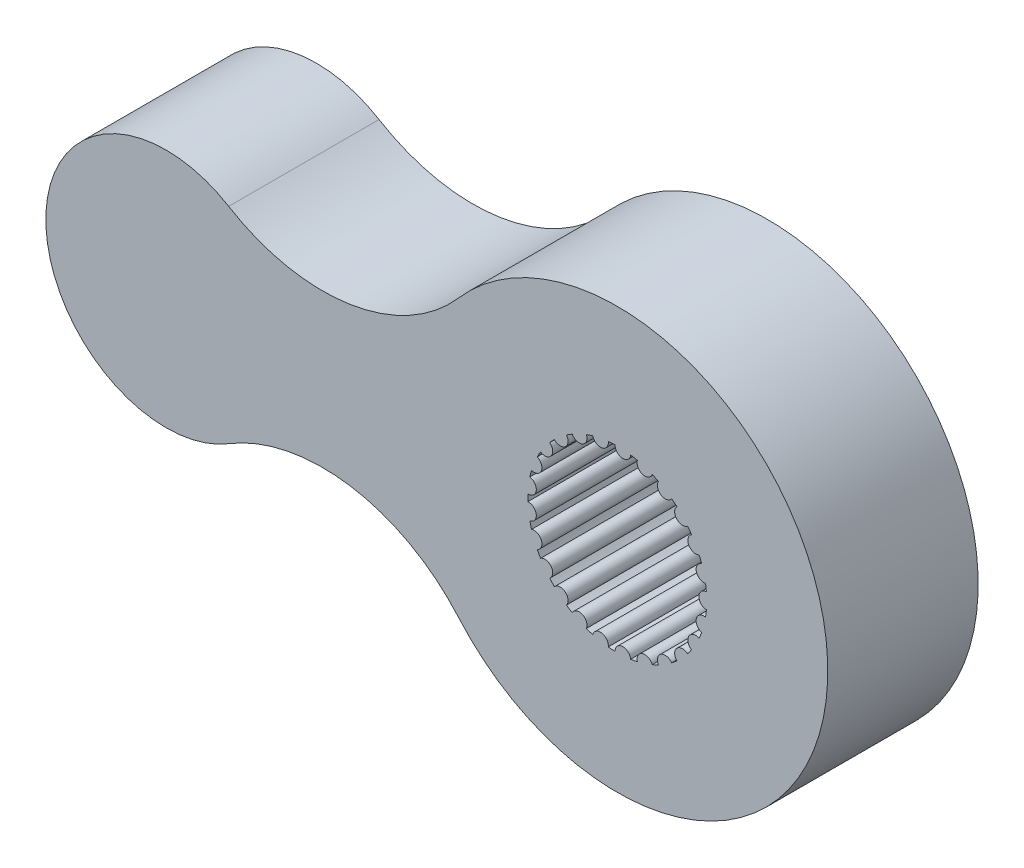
ISO-10303-21;
HEADER;
FILE_DESCRIPTION(('STEP AP214'),'2;1');
FILE_NAME('part.step','',(''),(''),'','','');
FILE_SCHEMA(('AUTOMOTIVE_DESIGN { 1 0 10303 214 1 1 1 1 }'));
ENDSEC;
DATA;
#1=APPLICATION_CONTEXT('core data for automotive mechanical design processes');
#2=APPLICATION_PROTOCOL_DEFINITION('international standard','automotive_design',2000,#1);
#3=PRODUCT_CONTEXT('',#1,'mechanical');
#4=PRODUCT('Part','Part','',(#3));
#5=PRODUCT_RELATED_PRODUCT_CATEGORY('part','',(#4));
#6=PRODUCT_DEFINITION_FORMATION('','',#4);
#7=PRODUCT_DEFINITION_CONTEXT('part definition',#1,'design');
#8=PRODUCT_DEFINITION('design','',#6,#7);
#9=PRODUCT_DEFINITION_SHAPE('','',#8);
#10=(LENGTH_UNIT() NAMED_UNIT(*) SI_UNIT(.MILLI.,.METRE.));
#11=(NAMED_UNIT(*) PLANE_ANGLE_UNIT() SI_UNIT($,.RADIAN.));
#12=(NAMED_UNIT(*) SI_UNIT($,.STERADIAN.) SOLID_ANGLE_UNIT());
#13=UNCERTAINTY_MEASURE_WITH_UNIT(LENGTH_MEASURE(1.E-05),#10,'distance_accuracy_value','');
#14=(GEOMETRIC_REPRESENTATION_CONTEXT(3) GLOBAL_UNCERTAINTY_ASSIGNED_CONTEXT((#13)) GLOBAL_UNIT_ASSIGNED_CONTEXT((#10,
#11,#12)) REPRESENTATION_CONTEXT('',''));
#15=CARTESIAN_POINT('',(0.,0.,0.));
#16=DIRECTION('',(0.,0.,1.));
#17=DIRECTION('',(1.,0.,0.));
#18=AXIS2_PLACEMENT_3D('',#15,#16,#17);
#19=CARTESIAN_POINT('',(0.,0.,5.));
#20=DIRECTION('',(0.,0.,-1.));
#21=DIRECTION('',(-1.,0.,0.));
#22=AXIS2_PLACEMENT_3D('',#19,#20,#21);
#23=CYLINDRICAL_SURFACE('',#22,2.975);
#24=DIRECTION('',(0.,0.,1.));
#25=VECTOR('',#24,1.);
#26=CARTESIAN_POINT('',(2.93512810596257,0.485435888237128,2.5));
#27=LINE('',#26,#25);
#28=CARTESIAN_POINT('',(2.93512810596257,0.485435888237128,0.));
#29=VERTEX_POINT('',#28);
#30=CARTESIAN_POINT('',(2.93512810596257,0.485435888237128,5.));
#31=VERTEX_POINT('',#30);
#32=EDGE_CURVE('E390',#29,#31,#27,.T.);
#33=ORIENTED_EDGE('',*,*,#32,.F.);
#34=CARTESIAN_POINT('',(0.,0.,0.));
#35=DIRECTION('',(0.,0.,1.));
#36=DIRECTION('',(1.,0.,0.));
#37=AXIS2_PLACEMENT_3D('',#34,#35,#36);
#38=CIRCLE('',#37,2.975);
#39=CARTESIAN_POINT('',(2.96363865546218,0.259751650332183,0.));
#40=VERTEX_POINT('',#39);
#41=EDGE_CURVE('E674',#40,#29,#38,.T.);
#42=ORIENTED_EDGE('',*,*,#41,.F.);
#43=DIRECTION('',(0.,0.,1.));
#44=VECTOR('',#43,1.);
#45=CARTESIAN_POINT('',(2.96363865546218,0.259751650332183,2.5));
#46=LINE('',#45,#44);
#47=CARTESIAN_POINT('',(2.96363865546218,0.259751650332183,5.));
#48=VERTEX_POINT('',#47);
#49=EDGE_CURVE('E706',#48,#40,#46,.F.);
#50=ORIENTED_EDGE('',*,*,#49,.F.);
#51=CARTESIAN_POINT('',(0.,0.,5.));
#52=DIRECTION('',(0.,0.,1.));
#53=DIRECTION('',(1.,0.,0.));
#54=AXIS2_PLACEMENT_3D('',#51,#52,#53);
#55=CIRCLE('',#54,2.975);
#56=EDGE_CURVE('E48',#48,#31,#55,.T.);
#57=ORIENTED_EDGE('',*,*,#56,.T.);
#58=EDGE_LOOP('',(#33,#42,#50,#57));
#59=FACE_BOUND('',#58,.T.);
#60=ADVANCED_FACE('F33',(#59),#23,.F.);
#61=DIRECTION('',(0.,0.,1.));
#62=VECTOR('',#61,1.);
#63=CARTESIAN_POINT('',(2.80593288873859,0.98861803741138,2.5));
#64=LINE('',#63,#62);
#65=CARTESIAN_POINT('',(2.80593288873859,0.98861803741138,5.));
#66=VERTEX_POINT('',#65);
#67=CARTESIAN_POINT('',(2.80593288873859,0.98861803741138,0.));
#68=VERTEX_POINT('',#67);
#69=EDGE_CURVE('E385',#66,#68,#64,.F.);
#70=ORIENTED_EDGE('',*,*,#69,.F.);
#71=CARTESIAN_POINT('',(2.72219266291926,1.20012170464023,5.));
#72=VERTEX_POINT('',#71);
#73=EDGE_CURVE('E375',#66,#72,#55,.T.);
#74=ORIENTED_EDGE('',*,*,#73,.T.);
#75=DIRECTION('',(0.,0.,1.));
#76=VECTOR('',#75,1.);
#77=CARTESIAN_POINT('',(2.72219266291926,1.20012170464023,2.5));
#78=LINE('',#77,#76);
#79=CARTESIAN_POINT('',(2.72219266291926,1.20012170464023,0.));
#80=VERTEX_POINT('',#79);
#81=EDGE_CURVE('E405',#80,#72,#78,.T.);
#82=ORIENTED_EDGE('',*,*,#81,.F.);
#83=EDGE_CURVE('E56',#68,#80,#38,.T.);
#84=ORIENTED_EDGE('',*,*,#83,.F.);
#85=EDGE_LOOP('',(#70,#74,#82,#84));
#86=FACE_BOUND('',#85,.T.);
#87=ADVANCED_FACE('F386',(#86),#23,.F.);
#88=DIRECTION('',(0.,0.,1.));
#89=VECTOR('',#88,1.);
#90=CARTESIAN_POINT('',(2.47192003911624,1.65536591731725,2.5));
#91=LINE('',#90,#89);
#92=CARTESIAN_POINT('',(2.47192003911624,1.65536591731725,5.));
#93=VERTEX_POINT('',#92);
#94=CARTESIAN_POINT('',(2.47192003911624,1.65536591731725,0.));
#95=VERTEX_POINT('',#94);
#96=EDGE_CURVE('E401',#93,#95,#91,.F.);
#97=ORIENTED_EDGE('',*,*,#96,.F.);
#98=CARTESIAN_POINT('',(2.33821184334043,1.8393994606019,5.));
#99=VERTEX_POINT('',#98);
#100=EDGE_CURVE('E383',#93,#99,#55,.T.);
#101=ORIENTED_EDGE('',*,*,#100,.T.);
#102=DIRECTION('',(0.,0.,1.));
#103=VECTOR('',#102,1.);
#104=CARTESIAN_POINT('',(2.33821184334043,1.8393994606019,2.5));
#105=LINE('',#104,#103);
#106=CARTESIAN_POINT('',(2.33821184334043,1.8393994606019,0.));
#107=VERTEX_POINT('',#106);
#108=EDGE_CURVE('E416',#107,#99,#105,.T.);
#109=ORIENTED_EDGE('',*,*,#108,.F.);
#110=EDGE_CURVE('E824',#95,#107,#38,.T.);
#111=ORIENTED_EDGE('',*,*,#110,.F.);
#112=EDGE_LOOP('',(#97,#101,#109,#111));
#113=FACE_BOUND('',#112,.T.);
#114=ADVANCED_FACE('F814',(#113),#23,.F.);
#115=DIRECTION('',(0.,0.,1.));
#116=VECTOR('',#115,1.);
#117=CARTESIAN_POINT('',(1.98258736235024,2.2181010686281,2.5));
#118=LINE('',#117,#116);
#119=CARTESIAN_POINT('',(1.98258736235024,2.2181010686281,5.));
#120=VERTEX_POINT('',#119);
#121=CARTESIAN_POINT('',(1.98258736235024,2.2181010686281,0.));
#122=VERTEX_POINT('',#121);
#123=EDGE_CURVE('E411',#120,#122,#118,.F.);
#124=ORIENTED_EDGE('',*,*,#123,.F.);
#125=CARTESIAN_POINT('',(1.80731257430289,2.36310098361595,5.));
#126=VERTEX_POINT('',#125);
#127=EDGE_CURVE('E804',#120,#126,#55,.T.);
#128=ORIENTED_EDGE('',*,*,#127,.T.);
#129=DIRECTION('',(0.,0.,1.));
#130=VECTOR('',#129,1.);
#131=CARTESIAN_POINT('',(1.80731257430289,2.36310098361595,2.5));
#132=LINE('',#131,#130);
#133=CARTESIAN_POINT('',(1.80731257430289,2.36310098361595,0.));
#134=VERTEX_POINT('',#133);
#135=EDGE_CURVE('E428',#134,#126,#132,.T.);
#136=ORIENTED_EDGE('',*,*,#135,.F.);
#137=EDGE_CURVE('E821',#122,#134,#38,.T.);
#138=ORIENTED_EDGE('',*,*,#137,.F.);
#139=EDGE_LOOP('',(#124,#128,#136,#138));
#140=FACE_BOUND('',#139,.T.);
#141=ADVANCED_FACE('F820',(#140),#23,.F.);
#142=DIRECTION('',(0.,0.,1.));
#143=VECTOR('',#142,1.);
#144=CARTESIAN_POINT('',(1.3686814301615,2.64146477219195,2.5));
#145=LINE('',#144,#143);
#146=CARTESIAN_POINT('',(1.3686814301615,2.64146477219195,5.));
#147=VERTEX_POINT('',#146);
#148=CARTESIAN_POINT('',(1.3686814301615,2.64146477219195,0.));
#149=VERTEX_POINT('',#148);
#150=EDGE_CURVE('E423',#147,#149,#145,.F.);
#151=ORIENTED_EDGE('',*,*,#150,.F.);
#152=CARTESIAN_POINT('',(1.16285320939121,2.73832018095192,5.));
#153=VERTEX_POINT('',#152);
#154=EDGE_CURVE('E800',#147,#153,#55,.T.);
#155=ORIENTED_EDGE('',*,*,#154,.T.);
#156=DIRECTION('',(0.,0.,1.));
#157=VECTOR('',#156,1.);
#158=CARTESIAN_POINT('',(1.16285320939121,2.73832018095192,2.5));
#159=LINE('',#158,#157);
#160=CARTESIAN_POINT('',(1.16285320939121,2.73832018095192,0.));
#161=VERTEX_POINT('',#160);
#162=EDGE_CURVE('E440',#161,#153,#159,.T.);
#163=ORIENTED_EDGE('',*,*,#162,.F.);
#164=EDGE_CURVE('E825',#149,#161,#38,.T.);
#165=ORIENTED_EDGE('',*,*,#164,.F.);
#166=EDGE_LOOP('',(#151,#155,#163,#165));
#167=FACE_BOUND('',#166,.T.);
#168=ADVANCED_FACE('F936',(#167),#23,.F.);
#169=DIRECTION('',(0.,0.,1.));
#170=VECTOR('',#169,1.);
#171=CARTESIAN_POINT('',(0.668776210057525,2.89885552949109,2.5));
#172=LINE('',#171,#170);
#173=CARTESIAN_POINT('',(0.668776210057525,2.89885552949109,5.));
#174=VERTEX_POINT('',#173);
#175=CARTESIAN_POINT('',(0.668776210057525,2.89885552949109,0.));
#176=VERTEX_POINT('',#175);
#177=EDGE_CURVE('E435',#174,#176,#172,.F.);
#178=ORIENTED_EDGE('',*,*,#177,.F.);
#179=CARTESIAN_POINT('',(0.445327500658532,2.94148065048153,5.));
#180=VERTEX_POINT('',#179);
#181=EDGE_CURVE('E796',#174,#180,#55,.T.);
#182=ORIENTED_EDGE('',*,*,#181,.T.);
#183=DIRECTION('',(0.,0.,1.));
#184=VECTOR('',#183,1.);
#185=CARTESIAN_POINT('',(0.445327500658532,2.94148065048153,2.5));
#186=LINE('',#185,#184);
#187=CARTESIAN_POINT('',(0.445327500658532,2.94148065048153,0.));
#188=VERTEX_POINT('',#187);
#189=EDGE_CURVE('E452',#188,#180,#186,.T.);
#190=ORIENTED_EDGE('',*,*,#189,.F.);
#191=EDGE_CURVE('E826',#176,#188,#38,.T.);
#192=ORIENTED_EDGE('',*,*,#191,.F.);
#193=EDGE_LOOP('',(#178,#182,#190,#192));
#194=FACE_BOUND('',#193,.T.);
#195=ADVANCED_FACE('F932',(#194),#23,.F.);
#196=DIRECTION('',(0.,0.,1.));
#197=VECTOR('',#196,1.);
#198=CARTESIAN_POINT('',(-0.0731506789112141,2.97410053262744,2.5));
#199=LINE('',#198,#197);
#200=CARTESIAN_POINT('',(-0.0731506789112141,2.97410053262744,5.));
#201=VERTEX_POINT('',#200);
#202=CARTESIAN_POINT('',(-0.0731506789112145,2.97410053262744,0.));
#203=VERTEX_POINT('',#202);
#204=EDGE_CURVE('E447',#201,#203,#199,.F.);
#205=ORIENTED_EDGE('',*,*,#204,.F.);
#206=CARTESIAN_POINT('',(-0.300179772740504,2.95981707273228,5.));
#207=VERTEX_POINT('',#206);
#208=EDGE_CURVE('E792',#201,#207,#55,.T.);
#209=ORIENTED_EDGE('',*,*,#208,.T.);
#210=DIRECTION('',(0.,0.,1.));
#211=VECTOR('',#210,1.);
#212=CARTESIAN_POINT('',(-0.300179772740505,2.95981707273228,2.5));
#213=LINE('',#212,#211);
#214=CARTESIAN_POINT('',(-0.300179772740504,2.95981707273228,0.));
#215=VERTEX_POINT('',#214);
#216=EDGE_CURVE('E464',#215,#207,#213,.T.);
#217=ORIENTED_EDGE('',*,*,#216,.F.);
#218=EDGE_CURVE('E828',#203,#215,#38,.T.);
#219=ORIENTED_EDGE('',*,*,#218,.F.);
#220=EDGE_LOOP('',(#205,#209,#217,#219));
#221=FACE_BOUND('',#220,.T.);
#222=ADVANCED_FACE('F929',(#221),#23,.F.);
#223=DIRECTION('',(0.,0.,1.));
#224=VECTOR('',#223,1.);
#225=CARTESIAN_POINT('',(-0.810481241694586,2.86247186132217,2.5));
#226=LINE('',#225,#224);
#227=CARTESIAN_POINT('',(-0.810481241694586,2.86247186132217,5.));
#228=VERTEX_POINT('',#227);
#229=CARTESIAN_POINT('',(-0.810481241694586,2.86247186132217,0.));
#230=VERTEX_POINT('',#229);
#231=EDGE_CURVE('E459',#228,#230,#226,.F.);
#232=ORIENTED_EDGE('',*,*,#231,.F.);
#233=CARTESIAN_POINT('',(-1.02682564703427,2.79217730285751,5.));
#234=VERTEX_POINT('',#233);
#235=EDGE_CURVE('E788',#228,#234,#55,.T.);
#236=ORIENTED_EDGE('',*,*,#235,.T.);
#237=DIRECTION('',(0.,0.,1.));
#238=VECTOR('',#237,1.);
#239=CARTESIAN_POINT('',(-1.02682564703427,2.79217730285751,2.5));
#240=LINE('',#239,#238);
#241=CARTESIAN_POINT('',(-1.02682564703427,2.79217730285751,0.));
#242=VERTEX_POINT('',#241);
#243=EDGE_CURVE('E476',#242,#234,#240,.T.);
#244=ORIENTED_EDGE('',*,*,#243,.F.);
#245=EDGE_CURVE('E830',#230,#242,#38,.T.);
#246=ORIENTED_EDGE('',*,*,#245,.F.);
#247=EDGE_LOOP('',(#232,#236,#244,#246));
#248=FACE_BOUND('',#247,.T.);
#249=ADVANCED_FACE('F924',(#248),#23,.F.);
#250=DIRECTION('',(0.,0.,1.));
#251=VECTOR('',#250,1.);
#252=CARTESIAN_POINT('',(-1.49688628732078,2.57098355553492,2.5));
#253=LINE('',#252,#251);
#254=CARTESIAN_POINT('',(-1.49688628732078,2.57098355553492,5.));
#255=VERTEX_POINT('',#254);
#256=CARTESIAN_POINT('',(-1.49688628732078,2.57098355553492,0.));
#257=VERTEX_POINT('',#256);
#258=EDGE_CURVE('E471',#255,#257,#253,.F.);
#259=ORIENTED_EDGE('',*,*,#258,.F.);
#260=CARTESIAN_POINT('',(-1.68895228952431,2.44909476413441,5.));
#261=VERTEX_POINT('',#260);
#262=EDGE_CURVE('E784',#255,#261,#55,.T.);
#263=ORIENTED_EDGE('',*,*,#262,.T.);
#264=DIRECTION('',(0.,0.,1.));
#265=VECTOR('',#264,1.);
#266=CARTESIAN_POINT('',(-1.68895228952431,2.44909476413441,2.5));
#267=LINE('',#266,#265);
#268=CARTESIAN_POINT('',(-1.68895228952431,2.44909476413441,0.));
#269=VERTEX_POINT('',#268);
#270=EDGE_CURVE('E488',#269,#261,#267,.T.);
#271=ORIENTED_EDGE('',*,*,#270,.F.);
#272=EDGE_CURVE('E832',#257,#269,#38,.T.);
#273=ORIENTED_EDGE('',*,*,#272,.F.);
#274=EDGE_LOOP('',(#259,#263,#271,#273));
#275=FACE_BOUND('',#274,.T.);
#276=ADVANCED_FACE('F921',(#275),#23,.F.);
#277=DIRECTION('',(0.,0.,1.));
#278=VECTOR('',#277,1.);
#279=CARTESIAN_POINT('',(-2.08923646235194,2.11795089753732,2.5));
#280=LINE('',#279,#278);
#281=CARTESIAN_POINT('',(-2.08923646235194,2.11795089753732,5.));
#282=VERTEX_POINT('',#281);
#283=CARTESIAN_POINT('',(-2.08923646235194,2.11795089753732,0.));
#284=VERTEX_POINT('',#283);
#285=EDGE_CURVE('E483',#282,#284,#280,.F.);
#286=ORIENTED_EDGE('',*,*,#285,.F.);
#287=CARTESIAN_POINT('',(-2.24495584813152,1.95212659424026,5.));
#288=VERTEX_POINT('',#287);
#289=EDGE_CURVE('E780',#282,#288,#55,.T.);
#290=ORIENTED_EDGE('',*,*,#289,.T.);
#291=DIRECTION('',(0.,0.,1.));
#292=VECTOR('',#291,1.);
#293=CARTESIAN_POINT('',(-2.24495584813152,1.95212659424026,2.5));
#294=LINE('',#293,#292);
#295=CARTESIAN_POINT('',(-2.24495584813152,1.95212659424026,0.));
#296=VERTEX_POINT('',#295);
#297=EDGE_CURVE('E500',#296,#288,#294,.T.);
#298=ORIENTED_EDGE('',*,*,#297,.F.);
#299=EDGE_CURVE('E834',#284,#296,#38,.T.);
#300=ORIENTED_EDGE('',*,*,#299,.F.);
#301=EDGE_LOOP('',(#286,#290,#298,#300));
#302=FACE_BOUND('',#301,.T.);
#303=ADVANCED_FACE('F916',(#302),#23,.F.);
#304=DIRECTION('',(0.,0.,1.));
#305=VECTOR('',#304,1.);
#306=CARTESIAN_POINT('',(-2.5503122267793,1.53183959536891,2.5));
#307=LINE('',#306,#305);
#308=CARTESIAN_POINT('',(-2.5503122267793,1.53183959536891,5.));
#309=VERTEX_POINT('',#308);
#310=CARTESIAN_POINT('',(-2.5503122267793,1.53183959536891,0.));
#311=VERTEX_POINT('',#310);
#312=EDGE_CURVE('E495',#309,#311,#307,.F.);
#313=ORIENTED_EDGE('',*,*,#312,.F.);
#314=CARTESIAN_POINT('',(-2.65990057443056,1.33249913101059,5.));
#315=VERTEX_POINT('',#314);
#316=EDGE_CURVE('E776',#309,#315,#55,.T.);
#317=ORIENTED_EDGE('',*,*,#316,.T.);
#318=DIRECTION('',(0.,0.,1.));
#319=VECTOR('',#318,1.);
#320=CARTESIAN_POINT('',(-2.65990057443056,1.33249913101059,2.5));
#321=LINE('',#320,#319);
#322=CARTESIAN_POINT('',(-2.65990057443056,1.33249913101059,0.));
#323=VERTEX_POINT('',#322);
#324=EDGE_CURVE('E512',#323,#315,#321,.T.);
#325=ORIENTED_EDGE('',*,*,#324,.F.);
#326=EDGE_CURVE('E836',#311,#323,#38,.T.);
#327=ORIENTED_EDGE('',*,*,#326,.F.);
#328=EDGE_LOOP('',(#313,#317,#325,#327));
#329=FACE_BOUND('',#328,.T.);
#330=ADVANCED_FACE('F913',(#329),#23,.F.);
#331=DIRECTION('',(0.,0.,1.));
#332=VECTOR('',#331,1.);
#333=CARTESIAN_POINT('',(-2.85114249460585,0.849477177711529,2.5));
#334=LINE('',#333,#332);
#335=CARTESIAN_POINT('',(-2.85114249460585,0.849477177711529,5.));
#336=VERTEX_POINT('',#335);
#337=CARTESIAN_POINT('',(-2.85114249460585,0.849477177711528,0.));
#338=VERTEX_POINT('',#337);
#339=EDGE_CURVE('E507',#336,#338,#334,.F.);
#340=ORIENTED_EDGE('',*,*,#339,.F.);
#341=CARTESIAN_POINT('',(-2.9077139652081,0.629145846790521,5.));
#342=VERTEX_POINT('',#341);
#343=EDGE_CURVE('E772',#336,#342,#55,.T.);
#344=ORIENTED_EDGE('',*,*,#343,.T.);
#345=DIRECTION('',(0.,0.,1.));
#346=VECTOR('',#345,1.);
#347=CARTESIAN_POINT('',(-2.9077139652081,0.62914584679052,2.5));
#348=LINE('',#347,#346);
#349=CARTESIAN_POINT('',(-2.9077139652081,0.629145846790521,0.));
#350=VERTEX_POINT('',#349);
#351=EDGE_CURVE('E524',#350,#342,#348,.T.);
#352=ORIENTED_EDGE('',*,*,#351,.F.);
#353=EDGE_CURVE('E838',#338,#350,#38,.T.);
#354=ORIENTED_EDGE('',*,*,#353,.F.);
#355=EDGE_LOOP('',(#340,#344,#352,#354));
#356=FACE_BOUND('',#355,.T.);
#357=ADVANCED_FACE('F908',(#356),#23,.F.);
#358=DIRECTION('',(0.,0.,1.));
#359=VECTOR('',#358,1.);
#360=CARTESIAN_POINT('',(-2.9728249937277,0.113738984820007,2.5));
#361=LINE('',#360,#359);
#362=CARTESIAN_POINT('',(-2.9728249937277,0.113738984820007,5.));
#363=VERTEX_POINT('',#362);
#364=CARTESIAN_POINT('',(-2.9728249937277,0.113738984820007,0.));
#365=VERTEX_POINT('',#364);
#366=EDGE_CURVE('E519',#363,#365,#361,.F.);
#367=ORIENTED_EDGE('',*,*,#366,.F.);
#368=CARTESIAN_POINT('',(-2.97282499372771,-0.113738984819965,5.));
#369=VERTEX_POINT('',#368);
#370=EDGE_CURVE('E768',#363,#369,#55,.T.);
#371=ORIENTED_EDGE('',*,*,#370,.T.);
#372=DIRECTION('',(0.,0.,1.));
#373=VECTOR('',#372,1.);
#374=CARTESIAN_POINT('',(-2.97282499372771,-0.113738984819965,2.5));
#375=LINE('',#374,#373);
#376=CARTESIAN_POINT('',(-2.97282499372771,-0.113738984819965,0.));
#377=VERTEX_POINT('',#376);
#378=EDGE_CURVE('E536',#377,#369,#375,.T.);
#379=ORIENTED_EDGE('',*,*,#378,.F.);
#380=EDGE_CURVE('E840',#365,#377,#38,.T.);
#381=ORIENTED_EDGE('',*,*,#380,.F.);
#382=EDGE_LOOP('',(#367,#371,#379,#381));
#383=FACE_BOUND('',#382,.T.);
#384=ADVANCED_FACE('F905',(#383),#23,.F.);
#385=DIRECTION('',(0.,0.,1.));
#386=VECTOR('',#385,1.);
#387=CARTESIAN_POINT('',(-2.90771396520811,-0.62914584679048,2.5));
#388=LINE('',#387,#386);
#389=CARTESIAN_POINT('',(-2.90771396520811,-0.62914584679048,5.));
#390=VERTEX_POINT('',#389);
#391=CARTESIAN_POINT('',(-2.90771396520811,-0.62914584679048,0.));
#392=VERTEX_POINT('',#391);
#393=EDGE_CURVE('E531',#390,#392,#388,.F.);
#394=ORIENTED_EDGE('',*,*,#393,.F.);
#395=CARTESIAN_POINT('',(-2.85114249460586,-0.849477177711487,5.));
#396=VERTEX_POINT('',#395);
#397=EDGE_CURVE('E764',#390,#396,#55,.T.);
#398=ORIENTED_EDGE('',*,*,#397,.T.);
#399=DIRECTION('',(0.,0.,1.));
#400=VECTOR('',#399,1.);
#401=CARTESIAN_POINT('',(-2.85114249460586,-0.849477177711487,2.5));
#402=LINE('',#401,#400);
#403=CARTESIAN_POINT('',(-2.85114249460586,-0.849477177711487,0.));
#404=VERTEX_POINT('',#403);
#405=EDGE_CURVE('E548',#404,#396,#402,.T.);
#406=ORIENTED_EDGE('',*,*,#405,.F.);
#407=EDGE_CURVE('E842',#392,#404,#38,.T.);
#408=ORIENTED_EDGE('',*,*,#407,.F.);
#409=EDGE_LOOP('',(#394,#398,#406,#408));
#410=FACE_BOUND('',#409,.T.);
#411=ADVANCED_FACE('F900',(#410),#23,.F.);
#412=DIRECTION('',(0.,0.,1.));
#413=VECTOR('',#412,1.);
#414=CARTESIAN_POINT('',(-2.65990057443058,-1.33249913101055,2.5));
#415=LINE('',#414,#413);
#416=CARTESIAN_POINT('',(-2.65990057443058,-1.33249913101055,5.));
#417=VERTEX_POINT('',#416);
#418=CARTESIAN_POINT('',(-2.65990057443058,-1.33249913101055,0.));
#419=VERTEX_POINT('',#418);
#420=EDGE_CURVE('E543',#417,#419,#415,.F.);
#421=ORIENTED_EDGE('',*,*,#420,.F.);
#422=CARTESIAN_POINT('',(-2.55031222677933,-1.53183959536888,5.));
#423=VERTEX_POINT('',#422);
#424=EDGE_CURVE('E760',#417,#423,#55,.T.);
#425=ORIENTED_EDGE('',*,*,#424,.T.);
#426=DIRECTION('',(0.,0.,1.));
#427=VECTOR('',#426,1.);
#428=CARTESIAN_POINT('',(-2.55031222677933,-1.53183959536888,2.5));
#429=LINE('',#428,#427);
#430=CARTESIAN_POINT('',(-2.55031222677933,-1.53183959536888,0.));
#431=VERTEX_POINT('',#430);
#432=EDGE_CURVE('E560',#431,#423,#429,.T.);
#433=ORIENTED_EDGE('',*,*,#432,.F.);
#434=EDGE_CURVE('E844',#419,#431,#38,.T.);
#435=ORIENTED_EDGE('',*,*,#434,.F.);
#436=EDGE_LOOP('',(#421,#425,#433,#435));
#437=FACE_BOUND('',#436,.T.);
#438=ADVANCED_FACE('F897',(#437),#23,.F.);
#439=DIRECTION('',(0.,0.,1.));
#440=VECTOR('',#439,1.);
#441=CARTESIAN_POINT('',(-2.24495584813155,-1.95212659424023,2.5));
#442=LINE('',#441,#440);
#443=CARTESIAN_POINT('',(-2.24495584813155,-1.95212659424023,5.));
#444=VERTEX_POINT('',#443);
#445=CARTESIAN_POINT('',(-2.24495584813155,-1.95212659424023,0.));
#446=VERTEX_POINT('',#445);
#447=EDGE_CURVE('E555',#444,#446,#442,.F.);
#448=ORIENTED_EDGE('',*,*,#447,.F.);
#449=CARTESIAN_POINT('',(-2.08923646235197,-2.11795089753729,5.));
#450=VERTEX_POINT('',#449);
#451=EDGE_CURVE('E756',#444,#450,#55,.T.);
#452=ORIENTED_EDGE('',*,*,#451,.T.);
#453=DIRECTION('',(0.,0.,1.));
#454=VECTOR('',#453,1.);
#455=CARTESIAN_POINT('',(-2.08923646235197,-2.11795089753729,2.5));
#456=LINE('',#455,#454);
#457=CARTESIAN_POINT('',(-2.08923646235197,-2.11795089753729,0.));
#458=VERTEX_POINT('',#457);
#459=EDGE_CURVE('E572',#458,#450,#456,.T.);
#460=ORIENTED_EDGE('',*,*,#459,.F.);
#461=EDGE_CURVE('E846',#446,#458,#38,.T.);
#462=ORIENTED_EDGE('',*,*,#461,.F.);
#463=EDGE_LOOP('',(#448,#452,#460,#462));
#464=FACE_BOUND('',#463,.T.);
#465=ADVANCED_FACE('F892',(#464),#23,.F.);
#466=DIRECTION('',(0.,0.,1.));
#467=VECTOR('',#466,1.);
#468=CARTESIAN_POINT('',(-1.68895228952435,-2.44909476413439,2.5));
#469=LINE('',#468,#467);
#470=CARTESIAN_POINT('',(-1.68895228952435,-2.44909476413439,5.));
#471=VERTEX_POINT('',#470);
#472=CARTESIAN_POINT('',(-1.68895228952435,-2.44909476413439,0.));
#473=VERTEX_POINT('',#472);
#474=EDGE_CURVE('E567',#471,#473,#469,.F.);
#475=ORIENTED_EDGE('',*,*,#474,.F.);
#476=CARTESIAN_POINT('',(-1.49688628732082,-2.5709835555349,5.));
#477=VERTEX_POINT('',#476);
#478=EDGE_CURVE('E752',#471,#477,#55,.T.);
#479=ORIENTED_EDGE('',*,*,#478,.T.);
#480=DIRECTION('',(0.,0.,1.));
#481=VECTOR('',#480,1.);
#482=CARTESIAN_POINT('',(-1.49688628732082,-2.5709835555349,2.5));
#483=LINE('',#482,#481);
#484=CARTESIAN_POINT('',(-1.49688628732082,-2.5709835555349,0.));
#485=VERTEX_POINT('',#484);
#486=EDGE_CURVE('E584',#485,#477,#483,.T.);
#487=ORIENTED_EDGE('',*,*,#486,.F.);
#488=EDGE_CURVE('E848',#473,#485,#38,.T.);
#489=ORIENTED_EDGE('',*,*,#488,.F.);
#490=EDGE_LOOP('',(#475,#479,#487,#489));
#491=FACE_BOUND('',#490,.T.);
#492=ADVANCED_FACE('F889',(#491),#23,.F.);
#493=DIRECTION('',(0.,0.,1.));
#494=VECTOR('',#493,1.);
#495=CARTESIAN_POINT('',(-1.02682564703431,-2.7921773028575,2.5));
#496=LINE('',#495,#494);
#497=CARTESIAN_POINT('',(-1.02682564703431,-2.7921773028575,5.));
#498=VERTEX_POINT('',#497);
#499=CARTESIAN_POINT('',(-1.02682564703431,-2.7921773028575,0.));
#500=VERTEX_POINT('',#499);
#501=EDGE_CURVE('E579',#498,#500,#496,.F.);
#502=ORIENTED_EDGE('',*,*,#501,.F.);
#503=CARTESIAN_POINT('',(-0.810481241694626,-2.86247186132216,5.));
#504=VERTEX_POINT('',#503);
#505=EDGE_CURVE('E748',#498,#504,#55,.T.);
#506=ORIENTED_EDGE('',*,*,#505,.T.);
#507=DIRECTION('',(0.,0.,1.));
#508=VECTOR('',#507,1.);
#509=CARTESIAN_POINT('',(-0.810481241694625,-2.86247186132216,2.5));
#510=LINE('',#509,#508);
#511=CARTESIAN_POINT('',(-0.810481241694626,-2.86247186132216,0.));
#512=VERTEX_POINT('',#511);
#513=EDGE_CURVE('E596',#512,#504,#510,.T.);
#514=ORIENTED_EDGE('',*,*,#513,.F.);
#515=EDGE_CURVE('E850',#500,#512,#38,.T.);
#516=ORIENTED_EDGE('',*,*,#515,.F.);
#517=EDGE_LOOP('',(#502,#506,#514,#516));
#518=FACE_BOUND('',#517,.T.);
#519=ADVANCED_FACE('F884',(#518),#23,.F.);
#520=DIRECTION('',(0.,0.,1.));
#521=VECTOR('',#520,1.);
#522=CARTESIAN_POINT('',(-0.300179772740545,-2.95981707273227,2.5));
#523=LINE('',#522,#521);
#524=CARTESIAN_POINT('',(-0.300179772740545,-2.95981707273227,5.));
#525=VERTEX_POINT('',#524);
#526=CARTESIAN_POINT('',(-0.300179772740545,-2.95981707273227,0.));
#527=VERTEX_POINT('',#526);
#528=EDGE_CURVE('E591',#525,#527,#523,.F.);
#529=ORIENTED_EDGE('',*,*,#528,.F.);
#530=CARTESIAN_POINT('',(-0.0731506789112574,-2.97410053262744,5.));
#531=VERTEX_POINT('',#530);
#532=EDGE_CURVE('E744',#525,#531,#55,.T.);
#533=ORIENTED_EDGE('',*,*,#532,.T.);
#534=DIRECTION('',(0.,0.,1.));
#535=VECTOR('',#534,1.);
#536=CARTESIAN_POINT('',(-0.0731506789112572,-2.97410053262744,2.5));
#537=LINE('',#536,#535);
#538=CARTESIAN_POINT('',(-0.0731506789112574,-2.97410053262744,0.));
#539=VERTEX_POINT('',#538);
#540=EDGE_CURVE('E608',#539,#531,#537,.T.);
#541=ORIENTED_EDGE('',*,*,#540,.F.);
#542=EDGE_CURVE('E852',#527,#539,#38,.T.);
#543=ORIENTED_EDGE('',*,*,#542,.F.);
#544=EDGE_LOOP('',(#529,#533,#541,#543));
#545=FACE_BOUND('',#544,.T.);
#546=ADVANCED_FACE('F881',(#545),#23,.F.);
#547=DIRECTION('',(0.,0.,1.));
#548=VECTOR('',#547,1.);
#549=CARTESIAN_POINT('',(0.44532750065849,-2.94148065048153,2.5));
#550=LINE('',#549,#548);
#551=CARTESIAN_POINT('',(0.44532750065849,-2.94148065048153,5.));
#552=VERTEX_POINT('',#551);
#553=CARTESIAN_POINT('',(0.44532750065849,-2.94148065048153,0.));
#554=VERTEX_POINT('',#553);
#555=EDGE_CURVE('E603',#552,#554,#550,.F.);
#556=ORIENTED_EDGE('',*,*,#555,.F.);
#557=CARTESIAN_POINT('',(0.668776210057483,-2.8988555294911,5.));
#558=VERTEX_POINT('',#557);
#559=EDGE_CURVE('E740',#552,#558,#55,.T.);
#560=ORIENTED_EDGE('',*,*,#559,.T.);
#561=DIRECTION('',(0.,0.,1.));
#562=VECTOR('',#561,1.);
#563=CARTESIAN_POINT('',(0.668776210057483,-2.8988555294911,2.5));
#564=LINE('',#563,#562);
#565=CARTESIAN_POINT('',(0.668776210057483,-2.8988555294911,0.));
#566=VERTEX_POINT('',#565);
#567=EDGE_CURVE('E620',#566,#558,#564,.T.);
#568=ORIENTED_EDGE('',*,*,#567,.F.);
#569=EDGE_CURVE('E854',#554,#566,#38,.T.);
#570=ORIENTED_EDGE('',*,*,#569,.F.);
#571=EDGE_LOOP('',(#556,#560,#568,#570));
#572=FACE_BOUND('',#571,.T.);
#573=ADVANCED_FACE('F876',(#572),#23,.F.);
#574=DIRECTION('',(0.,0.,1.));
#575=VECTOR('',#574,1.);
#576=CARTESIAN_POINT('',(1.16285320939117,-2.73832018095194,2.5));
#577=LINE('',#576,#575);
#578=CARTESIAN_POINT('',(1.16285320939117,-2.73832018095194,5.));
#579=VERTEX_POINT('',#578);
#580=CARTESIAN_POINT('',(1.16285320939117,-2.73832018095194,0.));
#581=VERTEX_POINT('',#580);
#582=EDGE_CURVE('E615',#579,#581,#577,.F.);
#583=ORIENTED_EDGE('',*,*,#582,.F.);
#584=CARTESIAN_POINT('',(1.36868143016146,-2.64146477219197,5.));
#585=VERTEX_POINT('',#584);
#586=EDGE_CURVE('E736',#579,#585,#55,.T.);
#587=ORIENTED_EDGE('',*,*,#586,.T.);
#588=DIRECTION('',(0.,0.,1.));
#589=VECTOR('',#588,1.);
#590=CARTESIAN_POINT('',(1.36868143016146,-2.64146477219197,2.5));
#591=LINE('',#590,#589);
#592=CARTESIAN_POINT('',(1.36868143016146,-2.64146477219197,0.));
#593=VERTEX_POINT('',#592);
#594=EDGE_CURVE('E632',#593,#585,#591,.T.);
#595=ORIENTED_EDGE('',*,*,#594,.F.);
#596=EDGE_CURVE('E856',#581,#593,#38,.T.);
#597=ORIENTED_EDGE('',*,*,#596,.F.);
#598=EDGE_LOOP('',(#583,#587,#595,#597));
#599=FACE_BOUND('',#598,.T.);
#600=ADVANCED_FACE('F873',(#599),#23,.F.);
#601=DIRECTION('',(0.,0.,1.));
#602=VECTOR('',#601,1.);
#603=CARTESIAN_POINT('',(1.80731257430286,-2.36310098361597,2.5));
#604=LINE('',#603,#602);
#605=CARTESIAN_POINT('',(1.80731257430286,-2.36310098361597,5.));
#606=VERTEX_POINT('',#605);
#607=CARTESIAN_POINT('',(1.80731257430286,-2.36310098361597,0.));
#608=VERTEX_POINT('',#607);
#609=EDGE_CURVE('E627',#606,#608,#604,.F.);
#610=ORIENTED_EDGE('',*,*,#609,.F.);
#611=CARTESIAN_POINT('',(1.98258736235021,-2.21810106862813,5.));
#612=VERTEX_POINT('',#611);
#613=EDGE_CURVE('E732',#606,#612,#55,.T.);
#614=ORIENTED_EDGE('',*,*,#613,.T.);
#615=DIRECTION('',(0.,0.,1.));
#616=VECTOR('',#615,1.);
#617=CARTESIAN_POINT('',(1.98258736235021,-2.21810106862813,2.5));
#618=LINE('',#617,#616);
#619=CARTESIAN_POINT('',(1.98258736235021,-2.21810106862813,0.));
#620=VERTEX_POINT('',#619);
#621=EDGE_CURVE('E644',#620,#612,#618,.T.);
#622=ORIENTED_EDGE('',*,*,#621,.F.);
#623=EDGE_CURVE('E858',#608,#620,#38,.T.);
#624=ORIENTED_EDGE('',*,*,#623,.F.);
#625=EDGE_LOOP('',(#610,#614,#622,#624));
#626=FACE_BOUND('',#625,.T.);
#627=ADVANCED_FACE('F868',(#626),#23,.F.);
#628=DIRECTION('',(0.,0.,1.));
#629=VECTOR('',#628,1.);
#630=CARTESIAN_POINT('',(2.3382118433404,-1.83939946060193,2.5));
#631=LINE('',#630,#629);
#632=CARTESIAN_POINT('',(2.3382118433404,-1.83939946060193,5.));
#633=VERTEX_POINT('',#632);
#634=CARTESIAN_POINT('',(2.3382118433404,-1.83939946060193,0.));
#635=VERTEX_POINT('',#634);
#636=EDGE_CURVE('E639',#633,#635,#631,.F.);
#637=ORIENTED_EDGE('',*,*,#636,.F.);
#638=CARTESIAN_POINT('',(2.47192003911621,-1.65536591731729,5.));
#639=VERTEX_POINT('',#638);
#640=EDGE_CURVE('E731',#633,#639,#55,.T.);
#641=ORIENTED_EDGE('',*,*,#640,.T.);
#642=DIRECTION('',(0.,0.,1.));
#643=VECTOR('',#642,1.);
#644=CARTESIAN_POINT('',(2.47192003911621,-1.65536591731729,2.5));
#645=LINE('',#644,#643);
#646=CARTESIAN_POINT('',(2.47192003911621,-1.65536591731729,0.));
#647=VERTEX_POINT('',#646);
#648=EDGE_CURVE('E656',#647,#639,#645,.T.);
#649=ORIENTED_EDGE('',*,*,#648,.F.);
#650=EDGE_CURVE('E727',#635,#647,#38,.T.);
#651=ORIENTED_EDGE('',*,*,#650,.F.);
#652=EDGE_LOOP('',(#637,#641,#649,#651));
#653=FACE_BOUND('',#652,.T.);
#654=ADVANCED_FACE('F861',(#653),#23,.F.);
#655=DIRECTION('',(0.,0.,1.));
#656=VECTOR('',#655,1.);
#657=CARTESIAN_POINT('',(2.72219266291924,-1.20012170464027,2.5));
#658=LINE('',#657,#656);
#659=CARTESIAN_POINT('',(2.72219266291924,-1.20012170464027,5.));
#660=VERTEX_POINT('',#659);
#661=CARTESIAN_POINT('',(2.72219266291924,-1.20012170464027,0.));
#662=VERTEX_POINT('',#661);
#663=EDGE_CURVE('E651',#660,#662,#658,.F.);
#664=ORIENTED_EDGE('',*,*,#663,.F.);
#665=CARTESIAN_POINT('',(2.80593288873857,-0.98861803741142,5.));
#666=VERTEX_POINT('',#665);
#667=EDGE_CURVE('E729',#660,#666,#55,.T.);
#668=ORIENTED_EDGE('',*,*,#667,.T.);
#669=DIRECTION('',(0.,0.,1.));
#670=VECTOR('',#669,1.);
#671=CARTESIAN_POINT('',(2.80593288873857,-0.98861803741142,2.5));
#672=LINE('',#671,#670);
#673=CARTESIAN_POINT('',(2.80593288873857,-0.98861803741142,0.));
#674=VERTEX_POINT('',#673);
#675=EDGE_CURVE('E11',#674,#666,#672,.T.);
#676=ORIENTED_EDGE('',*,*,#675,.F.);
#677=EDGE_CURVE('E723',#662,#674,#38,.T.);
#678=ORIENTED_EDGE('',*,*,#677,.F.);
#679=EDGE_LOOP('',(#664,#668,#676,#678));
#680=FACE_BOUND('',#679,.T.);
#681=ADVANCED_FACE('F728',(#680),#23,.F.);
#682=CARTESIAN_POINT('',(-12.4,-4.27083130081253,5.));
#683=DIRECTION('',(0.,0.,1.));
#684=DIRECTION('',(1.,0.,0.));
#685=AXIS2_PLACEMENT_3D('',#682,#683,#684);
#686=PLANE('',#685);
#687=ORIENTED_EDGE('',*,*,#73,.F.);
#688=CARTESIAN_POINT('',(2.88153490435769,0.739852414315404,5.));
#689=DIRECTION('',(0.,0.,1.));
#690=DIRECTION('',(1.,0.,0.));
#691=AXIS2_PLACEMENT_3D('',#688,#689,#690);
#692=CIRCLE('',#691,0.26);
#693=EDGE_CURVE('E379',#66,#31,#692,.T.);
#694=ORIENTED_EDGE('',*,*,#693,.T.);
#695=ORIENTED_EDGE('',*,*,#56,.F.);
#696=CARTESIAN_POINT('',(2.975,0.,5.));
#697=DIRECTION('',(0.,0.,1.));
#698=DIRECTION('',(1.,0.,0.));
#699=AXIS2_PLACEMENT_3D('',#696,#697,#698);
#700=CIRCLE('',#699,0.26);
#701=CARTESIAN_POINT('',(2.96363865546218,-0.259751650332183,5.));
#702=VERTEX_POINT('',#701);
#703=EDGE_CURVE('E663',#48,#702,#700,.T.);
#704=ORIENTED_EDGE('',*,*,#703,.T.);
#705=CARTESIAN_POINT('',(2.93512810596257,-0.485435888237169,5.));
#706=VERTEX_POINT('',#705);
#707=EDGE_CURVE('E673',#706,#702,#55,.T.);
#708=ORIENTED_EDGE('',*,*,#707,.F.);
#709=CARTESIAN_POINT('',(2.88153490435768,-0.739852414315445,5.));
#710=DIRECTION('',(0.,0.,1.));
#711=DIRECTION('',(1.,0.,0.));
#712=AXIS2_PLACEMENT_3D('',#709,#710,#711);
#713=CIRCLE('',#712,0.26);
#714=EDGE_CURVE('E659',#706,#666,#713,.T.);
#715=ORIENTED_EDGE('',*,*,#714,.T.);
#716=ORIENTED_EDGE('',*,*,#667,.F.);
#717=CARTESIAN_POINT('',(2.60701237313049,-1.43321718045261,5.));
#718=DIRECTION('',(0.,0.,1.));
#719=DIRECTION('',(1.,0.,0.));
#720=AXIS2_PLACEMENT_3D('',#717,#718,#719);
#721=CIRCLE('',#720,0.26);
#722=EDGE_CURVE('E647',#660,#639,#721,.T.);
#723=ORIENTED_EDGE('',*,*,#722,.T.);
#724=ORIENTED_EDGE('',*,*,#640,.F.);
#725=CARTESIAN_POINT('',(2.1686816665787,-2.03652764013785,5.));
#726=DIRECTION('',(0.,0.,1.));
#727=DIRECTION('',(1.,0.,0.));
#728=AXIS2_PLACEMENT_3D('',#725,#726,#727);
#729=CIRCLE('',#728,0.26);
#730=EDGE_CURVE('E635',#633,#612,#729,.T.);
#731=ORIENTED_EDGE('',*,*,#730,.T.);
#732=ORIENTED_EDGE('',*,*,#613,.F.);
#733=CARTESIAN_POINT('',(1.59408471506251,-2.5118755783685,5.));
#734=DIRECTION('',(0.,0.,1.));
#735=DIRECTION('',(1.,0.,0.));
#736=AXIS2_PLACEMENT_3D('',#733,#734,#735);
#737=CIRCLE('',#736,0.26);
#738=EDGE_CURVE('E623',#606,#585,#737,.T.);
#739=ORIENTED_EDGE('',*,*,#738,.T.);
#740=ORIENTED_EDGE('',*,*,#586,.F.);
#741=CARTESIAN_POINT('',(0.919325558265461,-2.82939313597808,5.));
#742=DIRECTION('',(0.,0.,1.));
#743=DIRECTION('',(1.,0.,0.));
#744=AXIS2_PLACEMENT_3D('',#741,#742,#743);
#745=CIRCLE('',#744,0.26);
#746=EDGE_CURVE('E611',#579,#558,#745,.T.);
#747=ORIENTED_EDGE('',*,*,#746,.T.);
#748=ORIENTED_EDGE('',*,*,#559,.F.);
#749=CARTESIAN_POINT('',(0.186801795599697,-2.96912951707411,5.));
#750=DIRECTION('',(0.,0.,1.));
#751=DIRECTION('',(1.,0.,0.));
#752=AXIS2_PLACEMENT_3D('',#749,#750,#751);
#753=CIRCLE('',#752,0.26);
#754=EDGE_CURVE('E599',#552,#531,#753,.T.);
#755=ORIENTED_EDGE('',*,*,#754,.T.);
#756=ORIENTED_EDGE('',*,*,#532,.F.);
#757=CARTESIAN_POINT('',(-0.557459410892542,-2.92230457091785,5.));
#758=DIRECTION('',(0.,0.,1.));
#759=DIRECTION('',(1.,0.,0.));
#760=AXIS2_PLACEMENT_3D('',#757,#758,#759);
#761=CIRCLE('',#760,0.26);
#762=EDGE_CURVE('E587',#525,#504,#761,.T.);
#763=ORIENTED_EDGE('',*,*,#762,.T.);
#764=ORIENTED_EDGE('',*,*,#505,.F.);
#765=CARTESIAN_POINT('',(-1.2666933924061,-2.6918604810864,5.));
#766=DIRECTION('',(0.,0.,1.));
#767=DIRECTION('',(1.,0.,0.));
#768=AXIS2_PLACEMENT_3D('',#765,#766,#767);
#769=CIRCLE('',#768,0.26);
#770=EDGE_CURVE('E575',#498,#477,#769,.T.);
#771=ORIENTED_EDGE('',*,*,#770,.T.);
#772=ORIENTED_EDGE('',*,*,#478,.F.);
#773=CARTESIAN_POINT('',(-1.89633636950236,-2.29227689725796,5.));
#774=DIRECTION('',(0.,0.,1.));
#775=DIRECTION('',(1.,0.,0.));
#776=AXIS2_PLACEMENT_3D('',#773,#774,#775);
#777=CIRCLE('',#776,0.259999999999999);
#778=EDGE_CURVE('E563',#471,#450,#777,.T.);
#779=ORIENTED_EDGE('',*,*,#778,.T.);
#780=ORIENTED_EDGE('',*,*,#451,.F.);
#781=CARTESIAN_POINT('',(-2.40682555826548,-1.74866112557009,5.));
#782=DIRECTION('',(0.,0.,1.));
#783=DIRECTION('',(1.,0.,0.));
#784=AXIS2_PLACEMENT_3D('',#781,#782,#783);
#785=CIRCLE('',#784,0.26);
#786=EDGE_CURVE('E551',#444,#423,#785,.T.);
#787=ORIENTED_EDGE('',*,*,#786,.T.);
#788=ORIENTED_EDGE('',*,*,#424,.F.);
#789=CARTESIAN_POINT('',(-2.76608504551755,-1.0951705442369,5.));
#790=DIRECTION('',(0.,0.,1.));
#791=DIRECTION('',(1.,0.,0.));
#792=AXIS2_PLACEMENT_3D('',#789,#790,#791);
#793=CIRCLE('',#792,0.26);
#794=EDGE_CURVE('E539',#417,#396,#793,.T.);
#795=ORIENTED_EDGE('',*,*,#794,.T.);
#796=ORIENTED_EDGE('',*,*,#397,.F.);
#797=CARTESIAN_POINT('',(-2.95154123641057,-0.372866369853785,5.));
#798=DIRECTION('',(0.,0.,1.));
#799=DIRECTION('',(1.,0.,0.));
#800=AXIS2_PLACEMENT_3D('',#797,#798,#799);
#801=CIRCLE('',#800,0.26);
#802=EDGE_CURVE('E527',#390,#369,#801,.T.);
#803=ORIENTED_EDGE('',*,*,#802,.T.);
#804=ORIENTED_EDGE('',*,*,#370,.F.);
#805=CARTESIAN_POINT('',(-2.95154123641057,0.372866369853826,5.));
#806=DIRECTION('',(0.,0.,1.));
#807=DIRECTION('',(1.,0.,0.));
#808=AXIS2_PLACEMENT_3D('',#805,#806,#807);
#809=CIRCLE('',#808,0.26);
#810=EDGE_CURVE('E515',#363,#342,#809,.T.);
#811=ORIENTED_EDGE('',*,*,#810,.T.);
#812=ORIENTED_EDGE('',*,*,#343,.F.);
#813=CARTESIAN_POINT('',(-2.76608504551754,1.09517054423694,5.));
#814=DIRECTION('',(0.,0.,1.));
#815=DIRECTION('',(1.,0.,0.));
#816=AXIS2_PLACEMENT_3D('',#813,#814,#815);
#817=CIRCLE('',#816,0.26);
#818=EDGE_CURVE('E503',#336,#315,#817,.T.);
#819=ORIENTED_EDGE('',*,*,#818,.T.);
#820=ORIENTED_EDGE('',*,*,#316,.F.);
#821=CARTESIAN_POINT('',(-2.40682555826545,1.74866112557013,5.));
#822=DIRECTION('',(0.,0.,1.));
#823=DIRECTION('',(1.,0.,0.));
#824=AXIS2_PLACEMENT_3D('',#821,#822,#823);
#825=CIRCLE('',#824,0.259999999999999);
#826=EDGE_CURVE('E491',#309,#288,#825,.T.);
#827=ORIENTED_EDGE('',*,*,#826,.T.);
#828=ORIENTED_EDGE('',*,*,#289,.F.);
#829=CARTESIAN_POINT('',(-1.89633636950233,2.29227689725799,5.));
#830=DIRECTION('',(0.,0.,1.));
#831=DIRECTION('',(1.,0.,0.));
#832=AXIS2_PLACEMENT_3D('',#829,#830,#831);
#833=CIRCLE('',#832,0.259999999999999);
#834=EDGE_CURVE('E479',#282,#261,#833,.T.);
#835=ORIENTED_EDGE('',*,*,#834,.T.);
#836=ORIENTED_EDGE('',*,*,#262,.F.);
#837=CARTESIAN_POINT('',(-1.26669339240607,2.69186048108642,5.));
#838=DIRECTION('',(0.,0.,1.));
#839=DIRECTION('',(1.,0.,0.));
#840=AXIS2_PLACEMENT_3D('',#837,#838,#839);
#841=CIRCLE('',#840,0.26);
#842=EDGE_CURVE('E467',#255,#234,#841,.T.);
#843=ORIENTED_EDGE('',*,*,#842,.T.);
#844=ORIENTED_EDGE('',*,*,#235,.F.);
#845=CARTESIAN_POINT('',(-0.557459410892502,2.92230457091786,5.));
#846=DIRECTION('',(0.,0.,1.));
#847=DIRECTION('',(1.,0.,0.));
#848=AXIS2_PLACEMENT_3D('',#845,#846,#847);
#849=CIRCLE('',#848,0.26);
#850=EDGE_CURVE('E455',#228,#207,#849,.T.);
#851=ORIENTED_EDGE('',*,*,#850,.T.);
#852=ORIENTED_EDGE('',*,*,#208,.F.);
#853=CARTESIAN_POINT('',(0.18680179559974,2.96912951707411,5.));
#854=DIRECTION('',(0.,0.,1.));
#855=DIRECTION('',(1.,0.,0.));
#856=AXIS2_PLACEMENT_3D('',#853,#854,#855);
#857=CIRCLE('',#856,0.26);
#858=EDGE_CURVE('E443',#201,#180,#857,.T.);
#859=ORIENTED_EDGE('',*,*,#858,.T.);
#860=ORIENTED_EDGE('',*,*,#181,.F.);
#861=CARTESIAN_POINT('',(0.919325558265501,2.82939313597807,5.));
#862=DIRECTION('',(0.,0.,1.));
#863=DIRECTION('',(1.,0.,0.));
#864=AXIS2_PLACEMENT_3D('',#861,#862,#863);
#865=CIRCLE('',#864,0.26);
#866=EDGE_CURVE('E431',#174,#153,#865,.T.);
#867=ORIENTED_EDGE('',*,*,#866,.T.);
#868=ORIENTED_EDGE('',*,*,#154,.F.);
#869=CARTESIAN_POINT('',(1.59408471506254,2.51187557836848,5.));
#870=DIRECTION('',(0.,0.,1.));
#871=DIRECTION('',(1.,0.,0.));
#872=AXIS2_PLACEMENT_3D('',#869,#870,#871);
#873=CIRCLE('',#872,0.26);
#874=EDGE_CURVE('E419',#147,#126,#873,.T.);
#875=ORIENTED_EDGE('',*,*,#874,.T.);
#876=ORIENTED_EDGE('',*,*,#127,.F.);
#877=CARTESIAN_POINT('',(2.16868166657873,2.03652764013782,5.));
#878=DIRECTION('',(0.,0.,1.));
#879=DIRECTION('',(1.,0.,0.));
#880=AXIS2_PLACEMENT_3D('',#877,#878,#879);
#881=CIRCLE('',#880,0.259999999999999);
#882=EDGE_CURVE('E407',#120,#99,#881,.T.);
#883=ORIENTED_EDGE('',*,*,#882,.T.);
#884=ORIENTED_EDGE('',*,*,#100,.F.);
#885=CARTESIAN_POINT('',(2.60701237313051,1.43321718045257,5.));
#886=DIRECTION('',(0.,0.,1.));
#887=DIRECTION('',(1.,0.,0.));
#888=AXIS2_PLACEMENT_3D('',#885,#886,#887);
#889=CIRCLE('',#888,0.26);
#890=EDGE_CURVE('E381',#93,#72,#889,.T.);
#891=ORIENTED_EDGE('',*,*,#890,.T.);
#892=EDGE_LOOP('',(#687,#694,#695,#704,#708,#715,#716,#723,#724,#731,#732,#739,#740,#747,#748,
#755,#756,#763,#764,#771,#772,#779,#780,#787,#788,#795,#796,#803,#804,#811,#812,#819,#820,#827,
#828,#835,#836,#843,#844,#851,#852,#859,#860,#867,#868,#875,#876,#883,#884,#891));
#893=FACE_BOUND('',#892,.T.);
#894=CARTESIAN_POINT('',(-9.8,-8.54166260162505,5.));
#895=DIRECTION('',(0.,0.,-1.));
#896=DIRECTION('',(1.,0.,0.));
#897=AXIS2_PLACEMENT_3D('',#894,#895,#896);
#898=CIRCLE('',#897,6.);
#899=CARTESIAN_POINT('',(-12.92,-3.41666504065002,5.));
#900=VERTEX_POINT('',#899);
#901=CARTESIAN_POINT('',(-5.27692307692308,-4.59935678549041,5.));
#902=VERTEX_POINT('',#901);
#903=EDGE_CURVE('E677',#900,#902,#898,.T.);
#904=ORIENTED_EDGE('',*,*,#903,.T.);
#905=CARTESIAN_POINT('',(0.,0.,5.));
#906=DIRECTION('',(0.,0.,1.));
#907=DIRECTION('',(1.,0.,0.));
#908=AXIS2_PLACEMENT_3D('',#905,#906,#907);
#909=CIRCLE('',#908,7.);
#910=CARTESIAN_POINT('',(-5.27692307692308,4.59935678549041,5.));
#911=VERTEX_POINT('',#910);
#912=EDGE_CURVE('E680',#902,#911,#909,.T.);
#913=ORIENTED_EDGE('',*,*,#912,.T.);
#914=CARTESIAN_POINT('',(-9.8,8.54166260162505,5.));
#915=DIRECTION('',(0.,0.,-1.));
#916=DIRECTION('',(1.,0.,0.));
#917=AXIS2_PLACEMENT_3D('',#914,#915,#916);
#918=CIRCLE('',#917,6.);
#919=CARTESIAN_POINT('',(-12.92,3.41666504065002,5.));
#920=VERTEX_POINT('',#919);
#921=EDGE_CURVE('E683',#911,#920,#918,.T.);
#922=ORIENTED_EDGE('',*,*,#921,.T.);
#923=CARTESIAN_POINT('',(-15.,0.,5.));
#924=DIRECTION('',(0.,0.,1.));
#925=DIRECTION('',(1.,0.,0.));
#926=AXIS2_PLACEMENT_3D('',#923,#924,#925);
#927=CIRCLE('',#926,4.);
#928=EDGE_CURVE('E685',#920,#900,#927,.T.);
#929=ORIENTED_EDGE('',*,*,#928,.T.);
#930=EDGE_LOOP('',(#904,#913,#922,#929));
#931=FACE_BOUND('',#930,.T.);
#932=ADVANCED_FACE('F376',(#893,#931),#686,.T.);
#933=CARTESIAN_POINT('',(-12.4,-4.27083130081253,0.));
#934=DIRECTION('',(0.,0.,1.));
#935=DIRECTION('',(1.,0.,0.));
#936=AXIS2_PLACEMENT_3D('',#933,#934,#935);
#937=PLANE('',#936);
#938=CARTESIAN_POINT('',(-9.8,-8.54166260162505,0.));
#939=DIRECTION('',(0.,0.,-1.));
#940=DIRECTION('',(1.,0.,0.));
#941=AXIS2_PLACEMENT_3D('',#938,#939,#940);
#942=CIRCLE('',#941,6.);
#943=CARTESIAN_POINT('',(-12.92,-3.41666504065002,0.));
#944=VERTEX_POINT('',#943);
#945=CARTESIAN_POINT('',(-5.27692307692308,-4.59935678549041,0.));
#946=VERTEX_POINT('',#945);
#947=EDGE_CURVE('E672',#944,#946,#942,.T.);
#948=ORIENTED_EDGE('',*,*,#947,.F.);
#949=CARTESIAN_POINT('',(-15.,0.,0.));
#950=DIRECTION('',(0.,0.,1.));
#951=DIRECTION('',(1.,0.,0.));
#952=AXIS2_PLACEMENT_3D('',#949,#950,#951);
#953=CIRCLE('',#952,4.);
#954=CARTESIAN_POINT('',(-12.92,3.41666504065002,0.));
#955=VERTEX_POINT('',#954);
#956=EDGE_CURVE('E681',#955,#944,#953,.T.);
#957=ORIENTED_EDGE('',*,*,#956,.F.);
#958=CARTESIAN_POINT('',(-9.8,8.54166260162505,0.));
#959=DIRECTION('',(0.,0.,-1.));
#960=DIRECTION('',(1.,0.,0.));
#961=AXIS2_PLACEMENT_3D('',#958,#959,#960);
#962=CIRCLE('',#961,6.);
#963=CARTESIAN_POINT('',(-5.27692307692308,4.59935678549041,0.));
#964=VERTEX_POINT('',#963);
#965=EDGE_CURVE('E692',#964,#955,#962,.T.);
#966=ORIENTED_EDGE('',*,*,#965,.F.);
#967=CARTESIAN_POINT('',(0.,0.,0.));
#968=DIRECTION('',(0.,0.,1.));
#969=DIRECTION('',(1.,0.,0.));
#970=AXIS2_PLACEMENT_3D('',#967,#968,#969);
#971=CIRCLE('',#970,7.);
#972=EDGE_CURVE('E690',#946,#964,#971,.T.);
#973=ORIENTED_EDGE('',*,*,#972,.F.);
#974=EDGE_LOOP('',(#948,#957,#966,#973));
#975=FACE_BOUND('',#974,.T.);
#976=ORIENTED_EDGE('',*,*,#41,.T.);
#977=CARTESIAN_POINT('',(2.88153490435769,0.739852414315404,0.));
#978=DIRECTION('',(0.,0.,1.));
#979=DIRECTION('',(1.,0.,0.));
#980=AXIS2_PLACEMENT_3D('',#977,#978,#979);
#981=CIRCLE('',#980,0.26);
#982=EDGE_CURVE('E391',#68,#29,#981,.T.);
#983=ORIENTED_EDGE('',*,*,#982,.F.);
#984=ORIENTED_EDGE('',*,*,#83,.T.);
#985=CARTESIAN_POINT('',(2.60701237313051,1.43321718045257,0.));
#986=DIRECTION('',(0.,0.,1.));
#987=DIRECTION('',(1.,0.,0.));
#988=AXIS2_PLACEMENT_3D('',#985,#986,#987);
#989=CIRCLE('',#988,0.26);
#990=EDGE_CURVE('E398',#95,#80,#989,.T.);
#991=ORIENTED_EDGE('',*,*,#990,.F.);
#992=ORIENTED_EDGE('',*,*,#110,.T.);
#993=CARTESIAN_POINT('',(2.16868166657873,2.03652764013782,0.));
#994=DIRECTION('',(0.,0.,1.));
#995=DIRECTION('',(1.,0.,0.));
#996=AXIS2_PLACEMENT_3D('',#993,#994,#995);
#997=CIRCLE('',#996,0.259999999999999);
#998=EDGE_CURVE('E408',#122,#107,#997,.T.);
#999=ORIENTED_EDGE('',*,*,#998,.F.);
#1000=ORIENTED_EDGE('',*,*,#137,.T.);
#1001=CARTESIAN_POINT('',(1.59408471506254,2.51187557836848,0.));
#1002=DIRECTION('',(0.,0.,1.));
#1003=DIRECTION('',(1.,0.,0.));
#1004=AXIS2_PLACEMENT_3D('',#1001,#1002,#1003);
#1005=CIRCLE('',#1004,0.26);
#1006=EDGE_CURVE('E420',#149,#134,#1005,.T.);
#1007=ORIENTED_EDGE('',*,*,#1006,.F.);
#1008=ORIENTED_EDGE('',*,*,#164,.T.);
#1009=CARTESIAN_POINT('',(0.919325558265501,2.82939313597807,0.));
#1010=DIRECTION('',(0.,0.,1.));
#1011=DIRECTION('',(1.,0.,0.));
#1012=AXIS2_PLACEMENT_3D('',#1009,#1010,#1011);
#1013=CIRCLE('',#1012,0.26);
#1014=EDGE_CURVE('E432',#176,#161,#1013,.T.);
#1015=ORIENTED_EDGE('',*,*,#1014,.F.);
#1016=ORIENTED_EDGE('',*,*,#191,.T.);
#1017=CARTESIAN_POINT('',(0.18680179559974,2.96912951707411,0.));
#1018=DIRECTION('',(0.,0.,1.));
#1019=DIRECTION('',(1.,0.,0.));
#1020=AXIS2_PLACEMENT_3D('',#1017,#1018,#1019);
#1021=CIRCLE('',#1020,0.26);
#1022=EDGE_CURVE('E444',#203,#188,#1021,.T.);
#1023=ORIENTED_EDGE('',*,*,#1022,.F.);
#1024=ORIENTED_EDGE('',*,*,#218,.T.);
#1025=CARTESIAN_POINT('',(-0.557459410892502,2.92230457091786,0.));
#1026=DIRECTION('',(0.,0.,1.));
#1027=DIRECTION('',(1.,0.,0.));
#1028=AXIS2_PLACEMENT_3D('',#1025,#1026,#1027);
#1029=CIRCLE('',#1028,0.26);
#1030=EDGE_CURVE('E456',#230,#215,#1029,.T.);
#1031=ORIENTED_EDGE('',*,*,#1030,.F.);
#1032=ORIENTED_EDGE('',*,*,#245,.T.);
#1033=CARTESIAN_POINT('',(-1.26669339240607,2.69186048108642,0.));
#1034=DIRECTION('',(0.,0.,1.));
#1035=DIRECTION('',(1.,0.,0.));
#1036=AXIS2_PLACEMENT_3D('',#1033,#1034,#1035);
#1037=CIRCLE('',#1036,0.26);
#1038=EDGE_CURVE('E468',#257,#242,#1037,.T.);
#1039=ORIENTED_EDGE('',*,*,#1038,.F.);
#1040=ORIENTED_EDGE('',*,*,#272,.T.);
#1041=CARTESIAN_POINT('',(-1.89633636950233,2.29227689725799,0.));
#1042=DIRECTION('',(0.,0.,1.));
#1043=DIRECTION('',(1.,0.,0.));
#1044=AXIS2_PLACEMENT_3D('',#1041,#1042,#1043);
#1045=CIRCLE('',#1044,0.259999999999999);
#1046=EDGE_CURVE('E480',#284,#269,#1045,.T.);
#1047=ORIENTED_EDGE('',*,*,#1046,.F.);
#1048=ORIENTED_EDGE('',*,*,#299,.T.);
#1049=CARTESIAN_POINT('',(-2.40682555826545,1.74866112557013,0.));
#1050=DIRECTION('',(0.,0.,1.));
#1051=DIRECTION('',(1.,0.,0.));
#1052=AXIS2_PLACEMENT_3D('',#1049,#1050,#1051);
#1053=CIRCLE('',#1052,0.259999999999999);
#1054=EDGE_CURVE('E492',#311,#296,#1053,.T.);
#1055=ORIENTED_EDGE('',*,*,#1054,.F.);
#1056=ORIENTED_EDGE('',*,*,#326,.T.);
#1057=CARTESIAN_POINT('',(-2.76608504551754,1.09517054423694,0.));
#1058=DIRECTION('',(0.,0.,1.));
#1059=DIRECTION('',(1.,0.,0.));
#1060=AXIS2_PLACEMENT_3D('',#1057,#1058,#1059);
#1061=CIRCLE('',#1060,0.26);
#1062=EDGE_CURVE('E504',#338,#323,#1061,.T.);
#1063=ORIENTED_EDGE('',*,*,#1062,.F.);
#1064=ORIENTED_EDGE('',*,*,#353,.T.);
#1065=CARTESIAN_POINT('',(-2.95154123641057,0.372866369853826,0.));
#1066=DIRECTION('',(0.,0.,1.));
#1067=DIRECTION('',(1.,0.,0.));
#1068=AXIS2_PLACEMENT_3D('',#1065,#1066,#1067);
#1069=CIRCLE('',#1068,0.26);
#1070=EDGE_CURVE('E516',#365,#350,#1069,.T.);
#1071=ORIENTED_EDGE('',*,*,#1070,.F.);
#1072=ORIENTED_EDGE('',*,*,#380,.T.);
#1073=CARTESIAN_POINT('',(-2.95154123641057,-0.372866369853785,0.));
#1074=DIRECTION('',(0.,0.,1.));
#1075=DIRECTION('',(1.,0.,0.));
#1076=AXIS2_PLACEMENT_3D('',#1073,#1074,#1075);
#1077=CIRCLE('',#1076,0.26);
#1078=EDGE_CURVE('E528',#392,#377,#1077,.T.);
#1079=ORIENTED_EDGE('',*,*,#1078,.F.);
#1080=ORIENTED_EDGE('',*,*,#407,.T.);
#1081=CARTESIAN_POINT('',(-2.76608504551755,-1.0951705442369,0.));
#1082=DIRECTION('',(0.,0.,1.));
#1083=DIRECTION('',(1.,0.,0.));
#1084=AXIS2_PLACEMENT_3D('',#1081,#1082,#1083);
#1085=CIRCLE('',#1084,0.26);
#1086=EDGE_CURVE('E540',#419,#404,#1085,.T.);
#1087=ORIENTED_EDGE('',*,*,#1086,.F.);
#1088=ORIENTED_EDGE('',*,*,#434,.T.);
#1089=CARTESIAN_POINT('',(-2.40682555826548,-1.74866112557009,0.));
#1090=DIRECTION('',(0.,0.,1.));
#1091=DIRECTION('',(1.,0.,0.));
#1092=AXIS2_PLACEMENT_3D('',#1089,#1090,#1091);
#1093=CIRCLE('',#1092,0.26);
#1094=EDGE_CURVE('E552',#446,#431,#1093,.T.);
#1095=ORIENTED_EDGE('',*,*,#1094,.F.);
#1096=ORIENTED_EDGE('',*,*,#461,.T.);
#1097=CARTESIAN_POINT('',(-1.89633636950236,-2.29227689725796,0.));
#1098=DIRECTION('',(0.,0.,1.));
#1099=DIRECTION('',(1.,0.,0.));
#1100=AXIS2_PLACEMENT_3D('',#1097,#1098,#1099);
#1101=CIRCLE('',#1100,0.259999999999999);
#1102=EDGE_CURVE('E564',#473,#458,#1101,.T.);
#1103=ORIENTED_EDGE('',*,*,#1102,.F.);
#1104=ORIENTED_EDGE('',*,*,#488,.T.);
#1105=CARTESIAN_POINT('',(-1.2666933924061,-2.6918604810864,0.));
#1106=DIRECTION('',(0.,0.,1.));
#1107=DIRECTION('',(1.,0.,0.));
#1108=AXIS2_PLACEMENT_3D('',#1105,#1106,#1107);
#1109=CIRCLE('',#1108,0.26);
#1110=EDGE_CURVE('E576',#500,#485,#1109,.T.);
#1111=ORIENTED_EDGE('',*,*,#1110,.F.);
#1112=ORIENTED_EDGE('',*,*,#515,.T.);
#1113=CARTESIAN_POINT('',(-0.557459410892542,-2.92230457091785,0.));
#1114=DIRECTION('',(0.,0.,1.));
#1115=DIRECTION('',(1.,0.,0.));
#1116=AXIS2_PLACEMENT_3D('',#1113,#1114,#1115);
#1117=CIRCLE('',#1116,0.26);
#1118=EDGE_CURVE('E588',#527,#512,#1117,.T.);
#1119=ORIENTED_EDGE('',*,*,#1118,.F.);
#1120=ORIENTED_EDGE('',*,*,#542,.T.);
#1121=CARTESIAN_POINT('',(0.186801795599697,-2.96912951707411,0.));
#1122=DIRECTION('',(0.,0.,1.));
#1123=DIRECTION('',(1.,0.,0.));
#1124=AXIS2_PLACEMENT_3D('',#1121,#1122,#1123);
#1125=CIRCLE('',#1124,0.26);
#1126=EDGE_CURVE('E600',#554,#539,#1125,.T.);
#1127=ORIENTED_EDGE('',*,*,#1126,.F.);
#1128=ORIENTED_EDGE('',*,*,#569,.T.);
#1129=CARTESIAN_POINT('',(0.919325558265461,-2.82939313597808,0.));
#1130=DIRECTION('',(0.,0.,1.));
#1131=DIRECTION('',(1.,0.,0.));
#1132=AXIS2_PLACEMENT_3D('',#1129,#1130,#1131);
#1133=CIRCLE('',#1132,0.26);
#1134=EDGE_CURVE('E612',#581,#566,#1133,.T.);
#1135=ORIENTED_EDGE('',*,*,#1134,.F.);
#1136=ORIENTED_EDGE('',*,*,#596,.T.);
#1137=CARTESIAN_POINT('',(1.59408471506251,-2.5118755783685,0.));
#1138=DIRECTION('',(0.,0.,1.));
#1139=DIRECTION('',(1.,0.,0.));
#1140=AXIS2_PLACEMENT_3D('',#1137,#1138,#1139);
#1141=CIRCLE('',#1140,0.26);
#1142=EDGE_CURVE('E624',#608,#593,#1141,.T.);
#1143=ORIENTED_EDGE('',*,*,#1142,.F.);
#1144=ORIENTED_EDGE('',*,*,#623,.T.);
#1145=CARTESIAN_POINT('',(2.1686816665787,-2.03652764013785,0.));
#1146=DIRECTION('',(0.,0.,1.));
#1147=DIRECTION('',(1.,0.,0.));
#1148=AXIS2_PLACEMENT_3D('',#1145,#1146,#1147);
#1149=CIRCLE('',#1148,0.26);
#1150=EDGE_CURVE('E636',#635,#620,#1149,.T.);
#1151=ORIENTED_EDGE('',*,*,#1150,.F.);
#1152=ORIENTED_EDGE('',*,*,#650,.T.);
#1153=CARTESIAN_POINT('',(2.60701237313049,-1.43321718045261,0.));
#1154=DIRECTION('',(0.,0.,1.));
#1155=DIRECTION('',(1.,0.,0.));
#1156=AXIS2_PLACEMENT_3D('',#1153,#1154,#1155);
#1157=CIRCLE('',#1156,0.26);
#1158=EDGE_CURVE('E648',#662,#647,#1157,.T.);
#1159=ORIENTED_EDGE('',*,*,#1158,.F.);
#1160=ORIENTED_EDGE('',*,*,#677,.T.);
#1161=CARTESIAN_POINT('',(2.88153490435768,-0.739852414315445,0.));
#1162=DIRECTION('',(0.,0.,1.));
#1163=DIRECTION('',(1.,0.,0.));
#1164=AXIS2_PLACEMENT_3D('',#1161,#1162,#1163);
#1165=CIRCLE('',#1164,0.26);
#1166=CARTESIAN_POINT('',(2.93512810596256,-0.485435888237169,0.));
#1167=VERTEX_POINT('',#1166);
#1168=EDGE_CURVE('E660',#1167,#674,#1165,.T.);
#1169=ORIENTED_EDGE('',*,*,#1168,.F.);
#1170=CARTESIAN_POINT('',(2.96363865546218,-0.259751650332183,0.));
#1171=VERTEX_POINT('',#1170);
#1172=EDGE_CURVE('E669',#1167,#1171,#38,.T.);
#1173=ORIENTED_EDGE('',*,*,#1172,.T.);
#1174=CARTESIAN_POINT('',(2.975,0.,0.));
#1175=DIRECTION('',(0.,0.,1.));
#1176=DIRECTION('',(1.,0.,0.));
#1177=AXIS2_PLACEMENT_3D('',#1174,#1175,#1176);
#1178=CIRCLE('',#1177,0.26);
#1179=EDGE_CURVE('E666',#40,#1171,#1178,.T.);
#1180=ORIENTED_EDGE('',*,*,#1179,.F.);
#1181=EDGE_LOOP('',(#976,#983,#984,#991,#992,#999,#1000,#1007,#1008,#1015,#1016,#1023,#1024,
#1031,#1032,#1039,#1040,#1047,#1048,#1055,#1056,#1063,#1064,#1071,#1072,#1079,#1080,#1087,#1088,
#1095,#1096,#1103,#1104,#1111,#1112,#1119,#1120,#1127,#1128,#1135,#1136,#1143,#1144,#1151,#1152,
#1159,#1160,#1169,#1173,#1180));
#1182=FACE_BOUND('',#1181,.T.);
#1183=ADVANCED_FACE('F719',(#975,#1182),#937,.F.);
#1184=CARTESIAN_POINT('',(-9.8,-8.54166260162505,5.));
#1185=DIRECTION('',(0.,0.,-1.));
#1186=DIRECTION('',(-1.,0.,0.));
#1187=AXIS2_PLACEMENT_3D('',#1184,#1185,#1186);
#1188=CYLINDRICAL_SURFACE('',#1187,6.);
#1189=ORIENTED_EDGE('',*,*,#947,.T.);
#1190=DIRECTION('',(0.,0.,-1.));
#1191=VECTOR('',#1190,1.);
#1192=CARTESIAN_POINT('',(-5.27692307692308,-4.59935678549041,5.));
#1193=LINE('',#1192,#1191);
#1194=EDGE_CURVE('E703',#902,#946,#1193,.T.);
#1195=ORIENTED_EDGE('',*,*,#1194,.F.);
#1196=ORIENTED_EDGE('',*,*,#903,.F.);
#1197=DIRECTION('',(0.,0.,-1.));
#1198=VECTOR('',#1197,1.);
#1199=CARTESIAN_POINT('',(-12.92,-3.41666504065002,5.));
#1200=LINE('',#1199,#1198);
#1201=EDGE_CURVE('E687',#900,#944,#1200,.T.);
#1202=ORIENTED_EDGE('',*,*,#1201,.T.);
#1203=EDGE_LOOP('',(#1189,#1195,#1196,#1202));
#1204=FACE_BOUND('',#1203,.T.);
#1205=ADVANCED_FACE('F35',(#1204),#1188,.F.);
#1206=CARTESIAN_POINT('',(0.,0.,5.));
#1207=DIRECTION('',(0.,0.,-1.));
#1208=DIRECTION('',(-1.,0.,0.));
#1209=AXIS2_PLACEMENT_3D('',#1206,#1207,#1208);
#1210=CYLINDRICAL_SURFACE('',#1209,7.);
#1211=ORIENTED_EDGE('',*,*,#972,.T.);
#1212=DIRECTION('',(0.,0.,-1.));
#1213=VECTOR('',#1212,1.);
#1214=CARTESIAN_POINT('',(-5.27692307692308,4.59935678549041,5.));
#1215=LINE('',#1214,#1213);
#1216=EDGE_CURVE('E700',#911,#964,#1215,.T.);
#1217=ORIENTED_EDGE('',*,*,#1216,.F.);
#1218=ORIENTED_EDGE('',*,*,#912,.F.);
#1219=ORIENTED_EDGE('',*,*,#1194,.T.);
#1220=EDGE_LOOP('',(#1211,#1217,#1218,#1219));
#1221=FACE_BOUND('',#1220,.T.);
#1222=ADVANCED_FACE('F1059',(#1221),#1210,.T.);
#1223=CARTESIAN_POINT('',(-9.8,8.54166260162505,5.));
#1224=DIRECTION('',(0.,0.,-1.));
#1225=DIRECTION('',(-1.,0.,0.));
#1226=AXIS2_PLACEMENT_3D('',#1223,#1224,#1225);
#1227=CYLINDRICAL_SURFACE('',#1226,6.);
#1228=ORIENTED_EDGE('',*,*,#965,.T.);
#1229=DIRECTION('',(0.,0.,-1.));
#1230=VECTOR('',#1229,1.);
#1231=CARTESIAN_POINT('',(-12.92,3.41666504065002,5.));
#1232=LINE('',#1231,#1230);
#1233=EDGE_CURVE('E697',#920,#955,#1232,.T.);
#1234=ORIENTED_EDGE('',*,*,#1233,.F.);
#1235=ORIENTED_EDGE('',*,*,#921,.F.);
#1236=ORIENTED_EDGE('',*,*,#1216,.T.);
#1237=EDGE_LOOP('',(#1228,#1234,#1235,#1236));
#1238=FACE_BOUND('',#1237,.T.);
#1239=ADVANCED_FACE('F964',(#1238),#1227,.F.);
#1240=CARTESIAN_POINT('',(-15.,0.,5.));
#1241=DIRECTION('',(0.,0.,-1.));
#1242=DIRECTION('',(-1.,0.,0.));
#1243=AXIS2_PLACEMENT_3D('',#1240,#1241,#1242);
#1244=CYLINDRICAL_SURFACE('',#1243,4.);
#1245=ORIENTED_EDGE('',*,*,#956,.T.);
#1246=ORIENTED_EDGE('',*,*,#1201,.F.);
#1247=ORIENTED_EDGE('',*,*,#928,.F.);
#1248=ORIENTED_EDGE('',*,*,#1233,.T.);
#1249=EDGE_LOOP('',(#1245,#1246,#1247,#1248));
#1250=FACE_BOUND('',#1249,.T.);
#1251=ADVANCED_FACE('F958',(#1250),#1244,.T.);
#1252=DIRECTION('',(0.,0.,1.));
#1253=VECTOR('',#1252,1.);
#1254=CARTESIAN_POINT('',(2.93512810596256,-0.485435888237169,2.5));
#1255=LINE('',#1254,#1253);
#1256=EDGE_CURVE('E41',#706,#1167,#1255,.F.);
#1257=ORIENTED_EDGE('',*,*,#1256,.F.);
#1258=ORIENTED_EDGE('',*,*,#707,.T.);
#1259=DIRECTION('',(0.,0.,1.));
#1260=VECTOR('',#1259,1.);
#1261=CARTESIAN_POINT('',(2.96363865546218,-0.259751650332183,2.5));
#1262=LINE('',#1261,#1260);
#1263=EDGE_CURVE('E709',#1171,#702,#1262,.T.);
#1264=ORIENTED_EDGE('',*,*,#1263,.F.);
#1265=ORIENTED_EDGE('',*,*,#1172,.F.);
#1266=EDGE_LOOP('',(#1257,#1258,#1264,#1265));
#1267=FACE_BOUND('',#1266,.T.);
#1268=ADVANCED_FACE('F950',(#1267),#23,.F.);
#1269=CARTESIAN_POINT('',(2.975,0.,0.));
#1270=DIRECTION('',(0.,0.,1.));
#1271=DIRECTION('',(1.,0.,0.));
#1272=AXIS2_PLACEMENT_3D('',#1269,#1270,#1271);
#1273=CYLINDRICAL_SURFACE('',#1272,0.26);
#1274=ORIENTED_EDGE('',*,*,#1179,.T.);
#1275=ORIENTED_EDGE('',*,*,#1263,.T.);
#1276=ORIENTED_EDGE('',*,*,#703,.F.);
#1277=ORIENTED_EDGE('',*,*,#49,.T.);
#1278=EDGE_LOOP('',(#1274,#1275,#1276,#1277));
#1279=FACE_BOUND('',#1278,.T.);
#1280=ADVANCED_FACE('F957',(#1279),#1273,.T.);
#1281=CARTESIAN_POINT('',(2.88153490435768,-0.739852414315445,0.));
#1282=DIRECTION('',(0.,0.,1.));
#1283=DIRECTION('',(1.,0.,0.));
#1284=AXIS2_PLACEMENT_3D('',#1281,#1282,#1283);
#1285=CYLINDRICAL_SURFACE('',#1284,0.26);
#1286=ORIENTED_EDGE('',*,*,#1168,.T.);
#1287=ORIENTED_EDGE('',*,*,#675,.T.);
#1288=ORIENTED_EDGE('',*,*,#714,.F.);
#1289=ORIENTED_EDGE('',*,*,#1256,.T.);
#1290=EDGE_LOOP('',(#1286,#1287,#1288,#1289));
#1291=FACE_BOUND('',#1290,.T.);
#1292=ADVANCED_FACE('F716',(#1291),#1285,.T.);
#1293=CARTESIAN_POINT('',(2.60701237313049,-1.43321718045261,0.));
#1294=DIRECTION('',(0.,0.,1.));
#1295=DIRECTION('',(1.,0.,0.));
#1296=AXIS2_PLACEMENT_3D('',#1293,#1294,#1295);
#1297=CYLINDRICAL_SURFACE('',#1296,0.26);
#1298=ORIENTED_EDGE('',*,*,#1158,.T.);
#1299=ORIENTED_EDGE('',*,*,#648,.T.);
#1300=ORIENTED_EDGE('',*,*,#722,.F.);
#1301=ORIENTED_EDGE('',*,*,#663,.T.);
#1302=EDGE_LOOP('',(#1298,#1299,#1300,#1301));
#1303=FACE_BOUND('',#1302,.T.);
#1304=ADVANCED_FACE('F864',(#1303),#1297,.T.);
#1305=CARTESIAN_POINT('',(2.1686816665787,-2.03652764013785,0.));
#1306=DIRECTION('',(0.,0.,1.));
#1307=DIRECTION('',(1.,0.,0.));
#1308=AXIS2_PLACEMENT_3D('',#1305,#1306,#1307);
#1309=CYLINDRICAL_SURFACE('',#1308,0.26);
#1310=ORIENTED_EDGE('',*,*,#1150,.T.);
#1311=ORIENTED_EDGE('',*,*,#621,.T.);
#1312=ORIENTED_EDGE('',*,*,#730,.F.);
#1313=ORIENTED_EDGE('',*,*,#636,.T.);
#1314=EDGE_LOOP('',(#1310,#1311,#1312,#1313));
#1315=FACE_BOUND('',#1314,.T.);
#1316=ADVANCED_FACE('F867',(#1315),#1309,.T.);
#1317=CARTESIAN_POINT('',(1.59408471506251,-2.5118755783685,0.));
#1318=DIRECTION('',(0.,0.,1.));
#1319=DIRECTION('',(1.,0.,0.));
#1320=AXIS2_PLACEMENT_3D('',#1317,#1318,#1319);
#1321=CYLINDRICAL_SURFACE('',#1320,0.26);
#1322=ORIENTED_EDGE('',*,*,#1142,.T.);
#1323=ORIENTED_EDGE('',*,*,#594,.T.);
#1324=ORIENTED_EDGE('',*,*,#738,.F.);
#1325=ORIENTED_EDGE('',*,*,#609,.T.);
#1326=EDGE_LOOP('',(#1322,#1323,#1324,#1325));
#1327=FACE_BOUND('',#1326,.T.);
#1328=ADVANCED_FACE('F871',(#1327),#1321,.T.);
#1329=CARTESIAN_POINT('',(0.919325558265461,-2.82939313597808,0.));
#1330=DIRECTION('',(0.,0.,1.));
#1331=DIRECTION('',(1.,0.,0.));
#1332=AXIS2_PLACEMENT_3D('',#1329,#1330,#1331);
#1333=CYLINDRICAL_SURFACE('',#1332,0.26);
#1334=ORIENTED_EDGE('',*,*,#1134,.T.);
#1335=ORIENTED_EDGE('',*,*,#567,.T.);
#1336=ORIENTED_EDGE('',*,*,#746,.F.);
#1337=ORIENTED_EDGE('',*,*,#582,.T.);
#1338=EDGE_LOOP('',(#1334,#1335,#1336,#1337));
#1339=FACE_BOUND('',#1338,.T.);
#1340=ADVANCED_FACE('F875',(#1339),#1333,.T.);
#1341=CARTESIAN_POINT('',(0.186801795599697,-2.96912951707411,0.));
#1342=DIRECTION('',(0.,0.,1.));
#1343=DIRECTION('',(1.,0.,0.));
#1344=AXIS2_PLACEMENT_3D('',#1341,#1342,#1343);
#1345=CYLINDRICAL_SURFACE('',#1344,0.26);
#1346=ORIENTED_EDGE('',*,*,#1126,.T.);
#1347=ORIENTED_EDGE('',*,*,#540,.T.);
#1348=ORIENTED_EDGE('',*,*,#754,.F.);
#1349=ORIENTED_EDGE('',*,*,#555,.T.);
#1350=EDGE_LOOP('',(#1346,#1347,#1348,#1349));
#1351=FACE_BOUND('',#1350,.T.);
#1352=ADVANCED_FACE('F879',(#1351),#1345,.T.);
#1353=CARTESIAN_POINT('',(-0.557459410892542,-2.92230457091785,0.));
#1354=DIRECTION('',(0.,0.,1.));
#1355=DIRECTION('',(1.,0.,0.));
#1356=AXIS2_PLACEMENT_3D('',#1353,#1354,#1355);
#1357=CYLINDRICAL_SURFACE('',#1356,0.26);
#1358=ORIENTED_EDGE('',*,*,#1118,.T.);
#1359=ORIENTED_EDGE('',*,*,#513,.T.);
#1360=ORIENTED_EDGE('',*,*,#762,.F.);
#1361=ORIENTED_EDGE('',*,*,#528,.T.);
#1362=EDGE_LOOP('',(#1358,#1359,#1360,#1361));
#1363=FACE_BOUND('',#1362,.T.);
#1364=ADVANCED_FACE('F883',(#1363),#1357,.T.);
#1365=CARTESIAN_POINT('',(-1.2666933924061,-2.6918604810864,0.));
#1366=DIRECTION('',(0.,0.,1.));
#1367=DIRECTION('',(1.,0.,0.));
#1368=AXIS2_PLACEMENT_3D('',#1365,#1366,#1367);
#1369=CYLINDRICAL_SURFACE('',#1368,0.26);
#1370=ORIENTED_EDGE('',*,*,#1110,.T.);
#1371=ORIENTED_EDGE('',*,*,#486,.T.);
#1372=ORIENTED_EDGE('',*,*,#770,.F.);
#1373=ORIENTED_EDGE('',*,*,#501,.T.);
#1374=EDGE_LOOP('',(#1370,#1371,#1372,#1373));
#1375=FACE_BOUND('',#1374,.T.);
#1376=ADVANCED_FACE('F887',(#1375),#1369,.T.);
#1377=CARTESIAN_POINT('',(-1.89633636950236,-2.29227689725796,0.));
#1378=DIRECTION('',(0.,0.,1.));
#1379=DIRECTION('',(1.,0.,0.));
#1380=AXIS2_PLACEMENT_3D('',#1377,#1378,#1379);
#1381=CYLINDRICAL_SURFACE('',#1380,0.259999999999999);
#1382=ORIENTED_EDGE('',*,*,#1102,.T.);
#1383=ORIENTED_EDGE('',*,*,#459,.T.);
#1384=ORIENTED_EDGE('',*,*,#778,.F.);
#1385=ORIENTED_EDGE('',*,*,#474,.T.);
#1386=EDGE_LOOP('',(#1382,#1383,#1384,#1385));
#1387=FACE_BOUND('',#1386,.T.);
#1388=ADVANCED_FACE('F891',(#1387),#1381,.T.);
#1389=CARTESIAN_POINT('',(-2.40682555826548,-1.74866112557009,0.));
#1390=DIRECTION('',(0.,0.,1.));
#1391=DIRECTION('',(1.,0.,0.));
#1392=AXIS2_PLACEMENT_3D('',#1389,#1390,#1391);
#1393=CYLINDRICAL_SURFACE('',#1392,0.26);
#1394=ORIENTED_EDGE('',*,*,#1094,.T.);
#1395=ORIENTED_EDGE('',*,*,#432,.T.);
#1396=ORIENTED_EDGE('',*,*,#786,.F.);
#1397=ORIENTED_EDGE('',*,*,#447,.T.);
#1398=EDGE_LOOP('',(#1394,#1395,#1396,#1397));
#1399=FACE_BOUND('',#1398,.T.);
#1400=ADVANCED_FACE('F895',(#1399),#1393,.T.);
#1401=CARTESIAN_POINT('',(-2.76608504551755,-1.0951705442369,0.));
#1402=DIRECTION('',(0.,0.,1.));
#1403=DIRECTION('',(1.,0.,0.));
#1404=AXIS2_PLACEMENT_3D('',#1401,#1402,#1403);
#1405=CYLINDRICAL_SURFACE('',#1404,0.26);
#1406=ORIENTED_EDGE('',*,*,#1086,.T.);
#1407=ORIENTED_EDGE('',*,*,#405,.T.);
#1408=ORIENTED_EDGE('',*,*,#794,.F.);
#1409=ORIENTED_EDGE('',*,*,#420,.T.);
#1410=EDGE_LOOP('',(#1406,#1407,#1408,#1409));
#1411=FACE_BOUND('',#1410,.T.);
#1412=ADVANCED_FACE('F899',(#1411),#1405,.T.);
#1413=CARTESIAN_POINT('',(-2.95154123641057,-0.372866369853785,0.));
#1414=DIRECTION('',(0.,0.,1.));
#1415=DIRECTION('',(1.,0.,0.));
#1416=AXIS2_PLACEMENT_3D('',#1413,#1414,#1415);
#1417=CYLINDRICAL_SURFACE('',#1416,0.26);
#1418=ORIENTED_EDGE('',*,*,#1078,.T.);
#1419=ORIENTED_EDGE('',*,*,#378,.T.);
#1420=ORIENTED_EDGE('',*,*,#802,.F.);
#1421=ORIENTED_EDGE('',*,*,#393,.T.);
#1422=EDGE_LOOP('',(#1418,#1419,#1420,#1421));
#1423=FACE_BOUND('',#1422,.T.);
#1424=ADVANCED_FACE('F903',(#1423),#1417,.T.);
#1425=CARTESIAN_POINT('',(-2.95154123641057,0.372866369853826,0.));
#1426=DIRECTION('',(0.,0.,1.));
#1427=DIRECTION('',(1.,0.,0.));
#1428=AXIS2_PLACEMENT_3D('',#1425,#1426,#1427);
#1429=CYLINDRICAL_SURFACE('',#1428,0.26);
#1430=ORIENTED_EDGE('',*,*,#1070,.T.);
#1431=ORIENTED_EDGE('',*,*,#351,.T.);
#1432=ORIENTED_EDGE('',*,*,#810,.F.);
#1433=ORIENTED_EDGE('',*,*,#366,.T.);
#1434=EDGE_LOOP('',(#1430,#1431,#1432,#1433));
#1435=FACE_BOUND('',#1434,.T.);
#1436=ADVANCED_FACE('F907',(#1435),#1429,.T.);
#1437=CARTESIAN_POINT('',(-2.76608504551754,1.09517054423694,0.));
#1438=DIRECTION('',(0.,0.,1.));
#1439=DIRECTION('',(1.,0.,0.));
#1440=AXIS2_PLACEMENT_3D('',#1437,#1438,#1439);
#1441=CYLINDRICAL_SURFACE('',#1440,0.26);
#1442=ORIENTED_EDGE('',*,*,#1062,.T.);
#1443=ORIENTED_EDGE('',*,*,#324,.T.);
#1444=ORIENTED_EDGE('',*,*,#818,.F.);
#1445=ORIENTED_EDGE('',*,*,#339,.T.);
#1446=EDGE_LOOP('',(#1442,#1443,#1444,#1445));
#1447=FACE_BOUND('',#1446,.T.);
#1448=ADVANCED_FACE('F911',(#1447),#1441,.T.);
#1449=CARTESIAN_POINT('',(-2.40682555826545,1.74866112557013,0.));
#1450=DIRECTION('',(0.,0.,1.));
#1451=DIRECTION('',(1.,0.,0.));
#1452=AXIS2_PLACEMENT_3D('',#1449,#1450,#1451);
#1453=CYLINDRICAL_SURFACE('',#1452,0.259999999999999);
#1454=ORIENTED_EDGE('',*,*,#1054,.T.);
#1455=ORIENTED_EDGE('',*,*,#297,.T.);
#1456=ORIENTED_EDGE('',*,*,#826,.F.);
#1457=ORIENTED_EDGE('',*,*,#312,.T.);
#1458=EDGE_LOOP('',(#1454,#1455,#1456,#1457));
#1459=FACE_BOUND('',#1458,.T.);
#1460=ADVANCED_FACE('F915',(#1459),#1453,.T.);
#1461=CARTESIAN_POINT('',(-1.89633636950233,2.29227689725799,0.));
#1462=DIRECTION('',(0.,0.,1.));
#1463=DIRECTION('',(1.,0.,0.));
#1464=AXIS2_PLACEMENT_3D('',#1461,#1462,#1463);
#1465=CYLINDRICAL_SURFACE('',#1464,0.259999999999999);
#1466=ORIENTED_EDGE('',*,*,#1046,.T.);
#1467=ORIENTED_EDGE('',*,*,#270,.T.);
#1468=ORIENTED_EDGE('',*,*,#834,.F.);
#1469=ORIENTED_EDGE('',*,*,#285,.T.);
#1470=EDGE_LOOP('',(#1466,#1467,#1468,#1469));
#1471=FACE_BOUND('',#1470,.T.);
#1472=ADVANCED_FACE('F919',(#1471),#1465,.T.);
#1473=CARTESIAN_POINT('',(-1.26669339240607,2.69186048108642,0.));
#1474=DIRECTION('',(0.,0.,1.));
#1475=DIRECTION('',(1.,0.,0.));
#1476=AXIS2_PLACEMENT_3D('',#1473,#1474,#1475);
#1477=CYLINDRICAL_SURFACE('',#1476,0.26);
#1478=ORIENTED_EDGE('',*,*,#1038,.T.);
#1479=ORIENTED_EDGE('',*,*,#243,.T.);
#1480=ORIENTED_EDGE('',*,*,#842,.F.);
#1481=ORIENTED_EDGE('',*,*,#258,.T.);
#1482=EDGE_LOOP('',(#1478,#1479,#1480,#1481));
#1483=FACE_BOUND('',#1482,.T.);
#1484=ADVANCED_FACE('F923',(#1483),#1477,.T.);
#1485=CARTESIAN_POINT('',(-0.557459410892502,2.92230457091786,0.));
#1486=DIRECTION('',(0.,0.,1.));
#1487=DIRECTION('',(1.,0.,0.));
#1488=AXIS2_PLACEMENT_3D('',#1485,#1486,#1487);
#1489=CYLINDRICAL_SURFACE('',#1488,0.26);
#1490=ORIENTED_EDGE('',*,*,#1030,.T.);
#1491=ORIENTED_EDGE('',*,*,#216,.T.);
#1492=ORIENTED_EDGE('',*,*,#850,.F.);
#1493=ORIENTED_EDGE('',*,*,#231,.T.);
#1494=EDGE_LOOP('',(#1490,#1491,#1492,#1493));
#1495=FACE_BOUND('',#1494,.T.);
#1496=ADVANCED_FACE('F927',(#1495),#1489,.T.);
#1497=CARTESIAN_POINT('',(0.18680179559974,2.96912951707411,0.));
#1498=DIRECTION('',(0.,0.,1.));
#1499=DIRECTION('',(1.,0.,0.));
#1500=AXIS2_PLACEMENT_3D('',#1497,#1498,#1499);
#1501=CYLINDRICAL_SURFACE('',#1500,0.26);
#1502=ORIENTED_EDGE('',*,*,#1022,.T.);
#1503=ORIENTED_EDGE('',*,*,#189,.T.);
#1504=ORIENTED_EDGE('',*,*,#858,.F.);
#1505=ORIENTED_EDGE('',*,*,#204,.T.);
#1506=EDGE_LOOP('',(#1502,#1503,#1504,#1505));
#1507=FACE_BOUND('',#1506,.T.);
#1508=ADVANCED_FACE('F931',(#1507),#1501,.T.);
#1509=CARTESIAN_POINT('',(0.919325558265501,2.82939313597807,0.));
#1510=DIRECTION('',(0.,0.,1.));
#1511=DIRECTION('',(1.,0.,0.));
#1512=AXIS2_PLACEMENT_3D('',#1509,#1510,#1511);
#1513=CYLINDRICAL_SURFACE('',#1512,0.26);
#1514=ORIENTED_EDGE('',*,*,#1014,.T.);
#1515=ORIENTED_EDGE('',*,*,#162,.T.);
#1516=ORIENTED_EDGE('',*,*,#866,.F.);
#1517=ORIENTED_EDGE('',*,*,#177,.T.);
#1518=EDGE_LOOP('',(#1514,#1515,#1516,#1517));
#1519=FACE_BOUND('',#1518,.T.);
#1520=ADVANCED_FACE('F935',(#1519),#1513,.T.);
#1521=CARTESIAN_POINT('',(1.59408471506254,2.51187557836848,0.));
#1522=DIRECTION('',(0.,0.,1.));
#1523=DIRECTION('',(1.,0.,0.));
#1524=AXIS2_PLACEMENT_3D('',#1521,#1522,#1523);
#1525=CYLINDRICAL_SURFACE('',#1524,0.26);
#1526=ORIENTED_EDGE('',*,*,#1006,.T.);
#1527=ORIENTED_EDGE('',*,*,#135,.T.);
#1528=ORIENTED_EDGE('',*,*,#874,.F.);
#1529=ORIENTED_EDGE('',*,*,#150,.T.);
#1530=EDGE_LOOP('',(#1526,#1527,#1528,#1529));
#1531=FACE_BOUND('',#1530,.T.);
#1532=ADVANCED_FACE('F938',(#1531),#1525,.T.);
#1533=CARTESIAN_POINT('',(2.16868166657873,2.03652764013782,0.));
#1534=DIRECTION('',(0.,0.,1.));
#1535=DIRECTION('',(1.,0.,0.));
#1536=AXIS2_PLACEMENT_3D('',#1533,#1534,#1535);
#1537=CYLINDRICAL_SURFACE('',#1536,0.259999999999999);
#1538=ORIENTED_EDGE('',*,*,#998,.T.);
#1539=ORIENTED_EDGE('',*,*,#108,.T.);
#1540=ORIENTED_EDGE('',*,*,#882,.F.);
#1541=ORIENTED_EDGE('',*,*,#123,.T.);
#1542=EDGE_LOOP('',(#1538,#1539,#1540,#1541));
#1543=FACE_BOUND('',#1542,.T.);
#1544=ADVANCED_FACE('F817',(#1543),#1537,.T.);
#1545=CARTESIAN_POINT('',(2.60701237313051,1.43321718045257,0.));
#1546=DIRECTION('',(0.,0.,1.));
#1547=DIRECTION('',(1.,0.,0.));
#1548=AXIS2_PLACEMENT_3D('',#1545,#1546,#1547);
#1549=CYLINDRICAL_SURFACE('',#1548,0.26);
#1550=ORIENTED_EDGE('',*,*,#990,.T.);
#1551=ORIENTED_EDGE('',*,*,#81,.T.);
#1552=ORIENTED_EDGE('',*,*,#890,.F.);
#1553=ORIENTED_EDGE('',*,*,#96,.T.);
#1554=EDGE_LOOP('',(#1550,#1551,#1552,#1553));
#1555=FACE_BOUND('',#1554,.T.);
#1556=ADVANCED_FACE('F945',(#1555),#1549,.T.);
#1557=CARTESIAN_POINT('',(2.88153490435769,0.739852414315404,0.));
#1558=DIRECTION('',(0.,0.,1.));
#1559=DIRECTION('',(1.,0.,0.));
#1560=AXIS2_PLACEMENT_3D('',#1557,#1558,#1559);
#1561=CYLINDRICAL_SURFACE('',#1560,0.26);
#1562=ORIENTED_EDGE('',*,*,#982,.T.);
#1563=ORIENTED_EDGE('',*,*,#32,.T.);
#1564=ORIENTED_EDGE('',*,*,#693,.F.);
#1565=ORIENTED_EDGE('',*,*,#69,.T.);
#1566=EDGE_LOOP('',(#1562,#1563,#1564,#1565));
#1567=FACE_BOUND('',#1566,.T.);
#1568=ADVANCED_FACE('F393',(#1567),#1561,.T.);
#1569=CLOSED_SHELL('',(#60,#87,#114,#141,#168,#195,#222,#249,#276,#303,#330,#357,#384,#411,#438,
#465,#492,#519,#546,#573,#600,#627,#654,#681,#932,#1183,#1205,#1222,#1239,#1251,#1268,#1280,
#1292,#1304,#1316,#1328,#1340,#1352,#1364,#1376,#1388,#1400,#1412,#1424,#1436,#1448,#1460,#1472,
#1484,#1496,#1508,#1520,#1532,#1544,#1556,#1568));
#1570=MANIFOLD_SOLID_BREP('B2',#1569);
#1571=ADVANCED_BREP_SHAPE_REPRESENTATION('',(#18,#1570),#14);
#1572=SHAPE_DEFINITION_REPRESENTATION(#9,#1571);
ENDSEC;
END-ISO-10303-21;
